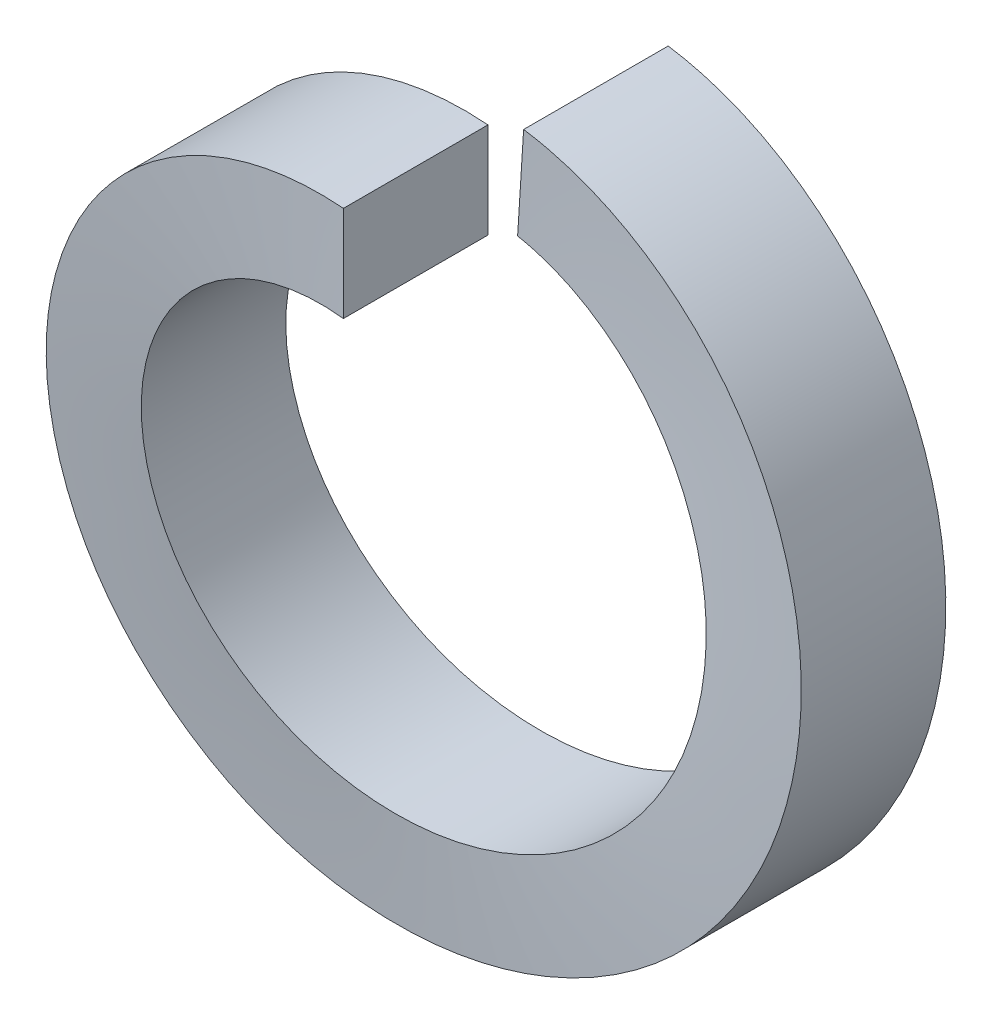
ISO-10303-21;
HEADER;
FILE_DESCRIPTION(('STEP AP214'),'2;1');
FILE_NAME('part.step','',(''),(''),'','','');
FILE_SCHEMA(('AUTOMOTIVE_DESIGN { 1 0 10303 214 1 1 1 1 }'));
ENDSEC;
DATA;
#1=APPLICATION_CONTEXT('core data for automotive mechanical design processes');
#2=APPLICATION_PROTOCOL_DEFINITION('international standard','automotive_design',2000,#1);
#3=PRODUCT_CONTEXT('',#1,'mechanical');
#4=PRODUCT('Part','Part','',(#3));
#5=PRODUCT_RELATED_PRODUCT_CATEGORY('part','',(#4));
#6=PRODUCT_DEFINITION_FORMATION('','',#4);
#7=PRODUCT_DEFINITION_CONTEXT('part definition',#1,'design');
#8=PRODUCT_DEFINITION('design','',#6,#7);
#9=PRODUCT_DEFINITION_SHAPE('','',#8);
#10=(LENGTH_UNIT() NAMED_UNIT(*) SI_UNIT(.MILLI.,.METRE.));
#11=(NAMED_UNIT(*) PLANE_ANGLE_UNIT() SI_UNIT($,.RADIAN.));
#12=(NAMED_UNIT(*) SI_UNIT($,.STERADIAN.) SOLID_ANGLE_UNIT());
#13=UNCERTAINTY_MEASURE_WITH_UNIT(LENGTH_MEASURE(1.E-05),#10,'distance_accuracy_value','');
#14=(GEOMETRIC_REPRESENTATION_CONTEXT(3) GLOBAL_UNCERTAINTY_ASSIGNED_CONTEXT((#13)) GLOBAL_UNIT_ASSIGNED_CONTEXT((#10,
#11,#12)) REPRESENTATION_CONTEXT('',''));
#15=CARTESIAN_POINT('',(0.,0.,0.));
#16=DIRECTION('',(0.,0.,1.));
#17=DIRECTION('',(1.,0.,0.));
#18=AXIS2_PLACEMENT_3D('',#15,#16,#17);
#19=CARTESIAN_POINT('',(0.,3.95605,1.9812));
#20=DIRECTION('',(1.,0.,0.));
#21=DIRECTION('',(0.,0.,-1.));
#22=AXIS2_PLACEMENT_3D('',#19,#20,#21);
#23=PLANE('',#22);
#24=CARTESIAN_POINT('',(0.,4.6101,1.9812));
#25=CARTESIAN_POINT('',(0.,3.302,1.9812));
#26=(BOUNDED_CURVE() B_SPLINE_CURVE(1,(#24,#25),.UNSPECIFIED.,.F.,
.F.) B_SPLINE_CURVE_WITH_KNOTS((2,2),(0.,1.),
.UNSPECIFIED.) CURVE() GEOMETRIC_REPRESENTATION_ITEM() RATIONAL_B_SPLINE_CURVE((1.,1.)) REPRESENTATION_ITEM(''));
#27=CARTESIAN_POINT('',(0.,4.6101,1.9812));
#28=VERTEX_POINT('',#27);
#29=CARTESIAN_POINT('',(0.,3.302,1.9812));
#30=VERTEX_POINT('',#29);
#31=EDGE_CURVE('E53',#28,#30,#26,.T.);
#32=ORIENTED_EDGE('',*,*,#31,.T.);
#33=CARTESIAN_POINT('',(0.,3.302,1.9812));
#34=CARTESIAN_POINT('',(0.,3.302,0.));
#35=(BOUNDED_CURVE() B_SPLINE_CURVE(1,(#33,#34),.UNSPECIFIED.,.F.,
.F.) B_SPLINE_CURVE_WITH_KNOTS((2,2),(0.,1.),
.UNSPECIFIED.) CURVE() GEOMETRIC_REPRESENTATION_ITEM() RATIONAL_B_SPLINE_CURVE((1.,1.)) REPRESENTATION_ITEM(''));
#36=CARTESIAN_POINT('',(0.,3.302,0.));
#37=VERTEX_POINT('',#36);
#38=EDGE_CURVE('E85',#30,#37,#35,.T.);
#39=ORIENTED_EDGE('',*,*,#38,.T.);
#40=CARTESIAN_POINT('',(0.,3.302,0.));
#41=CARTESIAN_POINT('',(0.,4.6101,0.));
#42=(BOUNDED_CURVE() B_SPLINE_CURVE(1,(#40,#41),.UNSPECIFIED.,.F.,
.F.) B_SPLINE_CURVE_WITH_KNOTS((2,2),(0.,1.),
.UNSPECIFIED.) CURVE() GEOMETRIC_REPRESENTATION_ITEM() RATIONAL_B_SPLINE_CURVE((1.,1.)) REPRESENTATION_ITEM(''));
#43=CARTESIAN_POINT('',(0.,4.6101,0.));
#44=VERTEX_POINT('',#43);
#45=EDGE_CURVE('E88',#37,#44,#42,.T.);
#46=ORIENTED_EDGE('',*,*,#45,.T.);
#47=CARTESIAN_POINT('',(0.,4.6101,0.));
#48=CARTESIAN_POINT('',(0.,4.6101,1.9812));
#49=(BOUNDED_CURVE() B_SPLINE_CURVE(1,(#47,#48),.UNSPECIFIED.,.F.,
.F.) B_SPLINE_CURVE_WITH_KNOTS((2,2),(0.,1.),
.UNSPECIFIED.) CURVE() GEOMETRIC_REPRESENTATION_ITEM() RATIONAL_B_SPLINE_CURVE((1.,1.)) REPRESENTATION_ITEM(''));
#50=EDGE_CURVE('E68',#44,#28,#49,.T.);
#51=ORIENTED_EDGE('',*,*,#50,.T.);
#52=EDGE_LOOP('',(#32,#39,#46,#51));
#53=FACE_BOUND('',#52,.T.);
#54=ADVANCED_FACE('F42',(#53),#23,.T.);
#55=CARTESIAN_POINT('',(0.227899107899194,3.62186201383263,-0.198642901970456));
#56=DIRECTION('',(0.998026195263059,-0.0627989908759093,1.77118714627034E-05));
#57=DIRECTION('',(0.0627989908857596,0.998026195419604,0.));
#58=AXIS2_PLACEMENT_3D('',#55,#56,#57);
#59=PLANE('',#58);
#60=CARTESIAN_POINT('',(0.28950962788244,4.60100056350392,-0.198642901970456));
#61=CARTESIAN_POINT('',(0.207362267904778,3.29548249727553,-0.198642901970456));
#62=(BOUNDED_CURVE() B_SPLINE_CURVE(1,(#60,#61),.UNSPECIFIED.,.F.,
.F.) B_SPLINE_CURVE_WITH_KNOTS((2,2),(0.,1.),
.UNSPECIFIED.) CURVE() GEOMETRIC_REPRESENTATION_ITEM() RATIONAL_B_SPLINE_CURVE((0.991095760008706,0.991095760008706)) REPRESENTATION_ITEM(''));
#63=CARTESIAN_POINT('',(0.207375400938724,3.29548167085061,-0.198641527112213));
#64=VERTEX_POINT('',#63);
#65=CARTESIAN_POINT('',(0.289509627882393,4.60100056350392,-0.198642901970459));
#66=VERTEX_POINT('',#65);
#67=EDGE_CURVE('E12',#64,#66,#62,.F.);
#68=ORIENTED_EDGE('',*,*,#67,.T.);
#69=CARTESIAN_POINT('',(0.289509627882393,4.60100056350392,-2.17984290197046));
#70=CARTESIAN_POINT('',(0.289509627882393,4.60100056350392,-0.198642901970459));
#71=(BOUNDED_CURVE() B_SPLINE_CURVE(1,(#69,#70),.UNSPECIFIED.,.F.,
.F.) B_SPLINE_CURVE_WITH_KNOTS((2,2),(0.,1.),
.UNSPECIFIED.) CURVE() GEOMETRIC_REPRESENTATION_ITEM() RATIONAL_B_SPLINE_CURVE((0.991095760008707,0.991095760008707)) REPRESENTATION_ITEM(''));
#72=CARTESIAN_POINT('',(0.289527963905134,4.60099940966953,-2.1798415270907));
#73=VERTEX_POINT('',#72);
#74=EDGE_CURVE('E134',#66,#73,#71,.F.);
#75=ORIENTED_EDGE('',*,*,#74,.T.);
#76=CARTESIAN_POINT('',(0.207388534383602,3.29548084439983,-2.17984015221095));
#77=CARTESIAN_POINT('',(0.289546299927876,4.60099825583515,-2.17984015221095));
#78=(BOUNDED_CURVE() B_SPLINE_CURVE(1,(#76,#77),.UNSPECIFIED.,.F.,
.F.) B_SPLINE_CURVE_WITH_KNOTS((2,2),(0.,1.),
.UNSPECIFIED.) CURVE() GEOMETRIC_REPRESENTATION_ITEM() RATIONAL_B_SPLINE_CURVE((0.9910947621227,0.9910947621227)) REPRESENTATION_ITEM(''));
#79=CARTESIAN_POINT('',(0.207388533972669,3.29548084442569,-2.17984015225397));
#80=VERTEX_POINT('',#79);
#81=EDGE_CURVE('E110',#73,#80,#78,.F.);
#82=ORIENTED_EDGE('',*,*,#81,.T.);
#83=CARTESIAN_POINT('',(0.207388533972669,3.29548084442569,-0.19864015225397));
#84=CARTESIAN_POINT('',(0.207388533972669,3.29548084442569,-2.17984015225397));
#85=(BOUNDED_CURVE() B_SPLINE_CURVE(1,(#83,#84),.UNSPECIFIED.,.F.,
.F.) B_SPLINE_CURVE_WITH_KNOTS((2,2),(0.,1.),
.UNSPECIFIED.) CURVE() GEOMETRIC_REPRESENTATION_ITEM() RATIONAL_B_SPLINE_CURVE((0.991094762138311,0.991094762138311)) REPRESENTATION_ITEM(''));
#86=EDGE_CURVE('E93',#80,#64,#85,.F.);
#87=ORIENTED_EDGE('',*,*,#86,.T.);
#88=EDGE_LOOP('',(#68,#75,#82,#87));
#89=FACE_BOUND('',#88,.T.);
#90=ADVANCED_FACE('F44',(#89),#59,.F.);
#91=CARTESIAN_POINT('',(0.,4.6101,1.9812));
#92=CARTESIAN_POINT('',(-1.49791229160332,4.6101,1.87113333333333));
#93=CARTESIAN_POINT('',(-2.70974879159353,3.72964924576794,1.76106666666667));
#94=CARTESIAN_POINT('',(-3.92158529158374,2.84919849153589,1.651));
#95=CARTESIAN_POINT('',(-4.38446564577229,1.42459924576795,1.54093333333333));
#96=CARTESIAN_POINT('',(-4.84734599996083,0.,1.43086666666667));
#97=CARTESIAN_POINT('',(-4.38446564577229,-1.42459924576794,1.3208));
#98=CARTESIAN_POINT('',(-3.92158529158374,-2.84919849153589,1.21073333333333));
#99=CARTESIAN_POINT('',(-2.70974879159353,-3.72964924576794,1.10066666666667));
#100=CARTESIAN_POINT('',(-1.49791229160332,-4.6101,0.9906));
#101=CARTESIAN_POINT('',(0.,-4.6101,0.880533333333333));
#102=CARTESIAN_POINT('',(1.49791229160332,-4.6101,0.770466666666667));
#103=CARTESIAN_POINT('',(2.70974879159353,-3.72964924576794,0.6604));
#104=CARTESIAN_POINT('',(3.92158529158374,-2.84919849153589,0.550333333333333));
#105=CARTESIAN_POINT('',(4.38446564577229,-1.42459924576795,0.440266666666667));
#106=CARTESIAN_POINT('',(4.84734599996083,0.,0.3302));
#107=CARTESIAN_POINT('',(4.38446564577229,1.42459924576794,0.220133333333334));
#108=CARTESIAN_POINT('',(3.92158529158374,2.84919849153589,0.110066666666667));
#109=CARTESIAN_POINT('',(2.70974879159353,3.72964924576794,0.));
#110=CARTESIAN_POINT('',(1.6262026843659,4.51689157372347,-0.098414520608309));
#111=CARTESIAN_POINT('',(0.28950962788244,4.60100056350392,-0.198642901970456));
#112=CARTESIAN_POINT('',(0.,3.302,1.9812));
#113=CARTESIAN_POINT('',(-1.07288483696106,3.302,1.87113333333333));
#114=CARTESIAN_POINT('',(-1.94086690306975,2.67137411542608,1.76106666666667));
#115=CARTESIAN_POINT('',(-2.80884896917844,2.04074823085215,1.651));
#116=CARTESIAN_POINT('',(-3.1403886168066,1.02037411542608,1.54093333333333));
#117=CARTESIAN_POINT('',(-3.47192826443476,0.,1.43086666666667));
#118=CARTESIAN_POINT('',(-3.1403886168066,-1.02037411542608,1.3208));
#119=CARTESIAN_POINT('',(-2.80884896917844,-2.04074823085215,1.21073333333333));
#120=CARTESIAN_POINT('',(-1.94086690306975,-2.67137411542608,1.10066666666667));
#121=CARTESIAN_POINT('',(-1.07288483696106,-3.302,0.9906));
#122=CARTESIAN_POINT('',(0.,-3.302,0.880533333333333));
#123=CARTESIAN_POINT('',(1.07288483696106,-3.302,0.770466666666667));
#124=CARTESIAN_POINT('',(1.94086690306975,-2.67137411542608,0.6604));
#125=CARTESIAN_POINT('',(2.80884896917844,-2.04074823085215,0.550333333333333));
#126=CARTESIAN_POINT('',(3.1403886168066,-1.02037411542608,0.440266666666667));
#127=CARTESIAN_POINT('',(3.47192826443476,0.,0.3302));
#128=CARTESIAN_POINT('',(3.1403886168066,1.02037411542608,0.220133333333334));
#129=CARTESIAN_POINT('',(2.80884896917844,2.04074823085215,0.110066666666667));
#130=CARTESIAN_POINT('',(1.94086690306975,2.67137411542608,0.));
#131=CARTESIAN_POINT('',(1.16477327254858,3.23523914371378,-0.098414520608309));
#132=CARTESIAN_POINT('',(0.207362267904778,3.29548249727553,-0.198642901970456));
#133=(BOUNDED_SURFACE() B_SPLINE_SURFACE(1,2,((#91,#92,#93,#94,#95,#96,#97,#98,#99,#100,#101,
#102,#103,#104,#105,#106,#107,#108,#109,#110,#111),(#112,#113,#114,#115,#116,#117,#118,#119,
#120,#121,#122,#123,#124,#125,#126,#127,#128,#129,#130,#131,#132)),.UNSPECIFIED.,.F.,.F.,
.F.) B_SPLINE_SURFACE_WITH_KNOTS((2,2),(3,2,2,2,2,2,2,2,2,2,3),(0.,1.),(0.,0.1,0.2,0.3,0.4,0.5,
0.6,0.7,0.8,0.9,0.989879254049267),
.UNSPECIFIED.) GEOMETRIC_REPRESENTATION_ITEM() RATIONAL_B_SPLINE_SURFACE(((1.,0.951056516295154,
1.,0.951056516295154,1.,0.951056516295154,1.,0.951056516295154,1.,0.951056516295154,1.,
0.951056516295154,1.,0.951056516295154,1.,0.951056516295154,1.,0.951056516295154,1.,
0.95600996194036,0.991095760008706),(1.,0.951056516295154,1.,0.951056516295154,1.,
0.951056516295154,1.,0.951056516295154,1.,0.951056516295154,1.,0.951056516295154,1.,
0.951056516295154,1.,0.951056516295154,1.,0.951056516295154,1.,0.95600996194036,0.991095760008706))) REPRESENTATION_ITEM('') SURFACE());
#134=CARTESIAN_POINT('',(0.,4.6101,1.9812));
#135=CARTESIAN_POINT('',(-1.49791229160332,4.6101,1.87113333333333));
#136=CARTESIAN_POINT('',(-2.70974879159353,3.72964924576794,1.76106666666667));
#137=CARTESIAN_POINT('',(-3.92158529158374,2.84919849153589,1.651));
#138=CARTESIAN_POINT('',(-4.38446564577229,1.42459924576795,1.54093333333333));
#139=CARTESIAN_POINT('',(-4.84734599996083,0.,1.43086666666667));
#140=CARTESIAN_POINT('',(-4.38446564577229,-1.42459924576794,1.3208));
#141=CARTESIAN_POINT('',(-3.92158529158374,-2.84919849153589,1.21073333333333));
#142=CARTESIAN_POINT('',(-2.70974879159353,-3.72964924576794,1.10066666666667));
#143=CARTESIAN_POINT('',(-1.49791229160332,-4.6101,0.9906));
#144=CARTESIAN_POINT('',(0.,-4.6101,0.880533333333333));
#145=CARTESIAN_POINT('',(1.49791229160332,-4.6101,0.770466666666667));
#146=CARTESIAN_POINT('',(2.70974879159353,-3.72964924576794,0.6604));
#147=CARTESIAN_POINT('',(3.92158529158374,-2.84919849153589,0.550333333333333));
#148=CARTESIAN_POINT('',(4.38446564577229,-1.42459924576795,0.440266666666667));
#149=CARTESIAN_POINT('',(4.84734599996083,0.,0.3302));
#150=CARTESIAN_POINT('',(4.38446564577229,1.42459924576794,0.220133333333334));
#151=CARTESIAN_POINT('',(3.92158529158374,2.84919849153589,0.110066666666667));
#152=CARTESIAN_POINT('',(2.70974879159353,3.72964924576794,0.));
#153=CARTESIAN_POINT('',(1.62620268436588,4.51689157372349,-0.0984145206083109));
#154=CARTESIAN_POINT('',(0.289509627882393,4.60100056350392,-0.198642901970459));
#155=(BOUNDED_CURVE() B_SPLINE_CURVE(2,(#134,#135,#136,#137,#138,#139,#140,#141,#142,#143,#144,
#145,#146,#147,#148,#149,#150,#151,#152,#153,#154),.UNSPECIFIED.,.F.,
.F.) B_SPLINE_CURVE_WITH_KNOTS((3,2,2,2,2,2,2,2,2,2,3),(0.,0.1,0.2,0.3,0.4,0.5,0.6,0.7,0.8,0.9,
0.989879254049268),
.UNSPECIFIED.) CURVE() GEOMETRIC_REPRESENTATION_ITEM() RATIONAL_B_SPLINE_CURVE((1.,
0.951056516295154,1.,0.951056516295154,1.,0.951056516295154,1.,0.951056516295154,1.,
0.951056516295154,1.,0.951056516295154,1.,0.951056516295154,1.,0.951056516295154,1.,
0.951056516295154,1.,0.956009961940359,0.991095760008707)) REPRESENTATION_ITEM(''));
#156=EDGE_CURVE('E60',#28,#66,#155,.T.);
#157=CARTESIAN_POINT('',(0.,3.302,1.9812));
#158=CARTESIAN_POINT('',(-0.0383632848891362,3.30200028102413,1.97726434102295));
#159=CARTESIAN_POINT('',(-0.0767242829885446,3.30133144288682,1.97330661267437));
#160=CARTESIAN_POINT('',(-0.153588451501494,3.29865129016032,1.96533182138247));
#161=CARTESIAN_POINT('',(-0.192091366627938,3.29663324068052,1.96131456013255));
#162=CARTESIAN_POINT('',(-0.269168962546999,3.29123856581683,1.9532273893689));
#163=CARTESIAN_POINT('',(-0.307743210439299,3.28785598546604,1.94915732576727));
#164=CARTESIAN_POINT('',(-0.384891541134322,3.27972143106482,1.94097156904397));
#165=CARTESIAN_POINT('',(-0.423465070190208,3.27496432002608,1.93685576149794));
#166=CARTESIAN_POINT('',(-0.5005388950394,3.26407480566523,1.92858581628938));
#167=CARTESIAN_POINT('',(-0.539038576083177,3.25793811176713,1.92443159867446));
#168=CARTESIAN_POINT('',(-0.615890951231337,3.24428872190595,1.91609237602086));
#169=CARTESIAN_POINT('',(-0.654243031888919,3.23677260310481,1.91190731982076));
#170=CARTESIAN_POINT('',(-0.730726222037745,3.22036888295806,1.90351416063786));
#171=CARTESIAN_POINT('',(-0.768856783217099,3.21147873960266,1.8993060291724));
#172=CARTESIAN_POINT('',(-0.844823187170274,3.19233676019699,1.89087461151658));
#173=CARTESIAN_POINT('',(-0.882658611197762,3.18208326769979,1.88665131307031));
#174=CARTESIAN_POINT('',(-0.957961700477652,3.16022962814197,1.87819755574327));
#175=CARTESIAN_POINT('',(-0.995429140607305,3.14862870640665,1.87396709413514));
#176=CARTESIAN_POINT('',(-1.06992439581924,3.12410042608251,1.8655070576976));
#177=CARTESIAN_POINT('',(-1.10695224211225,3.11117316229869,1.86127748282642));
#178=CARTESIAN_POINT('',(-1.18049807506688,3.08401747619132,1.85282726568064));
#179=CARTESIAN_POINT('',(-1.2170164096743,3.0697899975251,1.84860661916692));
#180=CARTESIAN_POINT('',(-1.28947505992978,3.04006405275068,1.84018226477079));
#181=CARTESIAN_POINT('',(-1.32541609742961,3.02456735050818,1.83597854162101));
#182=CARTESIAN_POINT('',(-1.39665448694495,2.99233781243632,1.82759590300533));
#183=CARTESIAN_POINT('',(-1.43195298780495,2.97560752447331,1.82341695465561));
#184=CARTESIAN_POINT('',(-1.5018435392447,2.94095008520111,1.8150917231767));
#185=CARTESIAN_POINT('',(-1.53643721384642,2.92302622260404,1.81094538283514));
#186=CARTESIAN_POINT('',(-1.60485856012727,2.88602506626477,1.80269251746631));
#187=CARTESIAN_POINT('',(-1.63868837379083,2.86695175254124,1.79858590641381));
#188=CARTESIAN_POINT('',(-1.70552618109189,2.82769881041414,1.79042130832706));
#189=CARTESIAN_POINT('',(-1.7385368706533,2.8075237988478,1.78636319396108));
#190=CARTESIAN_POINT('',(-1.80368390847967,2.76611845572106,1.7782970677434));
#191=CARTESIAN_POINT('',(-1.83582353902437,2.74489331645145,1.77428891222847));
#192=CARTESIAN_POINT('',(-1.89919076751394,2.70143426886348,1.76634891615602));
#193=CARTESIAN_POINT('',(-1.93042204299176,2.6792057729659,1.76241679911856));
#194=CARTESIAN_POINT('',(-1.99215336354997,2.63362945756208,1.75451657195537));
#195=CARTESIAN_POINT('',(-2.02265175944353,2.61027941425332,1.75054840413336));
#196=CARTESIAN_POINT('',(-2.08295930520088,2.56241561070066,1.74255010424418));
#197=CARTESIAN_POINT('',(-2.11276435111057,2.53789671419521,1.73851976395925));
#198=CARTESIAN_POINT('',(-2.17161971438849,2.48772456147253,1.73040905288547));
#199=CARTESIAN_POINT('',(-2.20066626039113,2.46206690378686,1.72632854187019));
#200=CARTESIAN_POINT('',(-2.25794031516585,2.40965183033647,1.71812317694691));
#201=CARTESIAN_POINT('',(-2.28616444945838,2.38289074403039,1.71399821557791));
#202=CARTESIAN_POINT('',(-2.34173165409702,2.32830800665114,1.70571168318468));
#203=CARTESIAN_POINT('',(-2.36907181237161,2.30048340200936,1.70155003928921));
#204=CARTESIAN_POINT('',(-2.42281156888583,2.24381738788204,1.69319763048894));
#205=CARTESIAN_POINT('',(-2.44920877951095,2.21497372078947,1.6890068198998));
#206=CARTESIAN_POINT('',(-2.50100613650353,2.15631765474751,1.68060388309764));
#207=CARTESIAN_POINT('',(-2.526404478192,2.12650366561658,1.67639173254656));
#208=CARTESIAN_POINT('',(-2.57615096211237,2.06595909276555,1.66795402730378));
#209=CARTESIAN_POINT('',(-2.60049793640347,2.03522755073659,1.66372846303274));
#210=CARTESIAN_POINT('',(-2.64809228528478,1.97290377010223,1.65527194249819));
#211=CARTESIAN_POINT('',(-2.67133917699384,1.94131116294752,1.65104098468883));
#212=CARTESIAN_POINT('',(-2.71668802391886,1.87732457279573,1.64258172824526));
#213=CARTESIAN_POINT('',(-2.73879022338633,1.84493076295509,1.63835342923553));
#214=CARTESIAN_POINT('',(-2.78180870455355,1.77940413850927,1.62990753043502));
#215=CARTESIAN_POINT('',(-2.80272599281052,1.74627198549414,1.62568992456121));
#216=CARTESIAN_POINT('',(-2.84333827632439,1.67933369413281,1.61727339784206));
#217=CARTESIAN_POINT('',(-2.86303506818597,1.64552864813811,1.61307445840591));
#218=CARTESIAN_POINT('',(-2.9011747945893,1.57731181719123,1.60470311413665));
#219=CARTESIAN_POINT('',(-2.9196203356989,1.54290149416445,1.60053067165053));
#220=CARTESIAN_POINT('',(-2.95523096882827,1.47354312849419,1.59222010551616));
#221=CARTESIAN_POINT('',(-2.97239948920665,1.43859685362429,1.58808191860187));
#222=CARTESIAN_POINT('',(-3.00543456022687,1.36823696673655,1.57984709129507));
#223=CARTESIAN_POINT('',(-3.02130536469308,1.33282536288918,1.57575035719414));
#224=CARTESIAN_POINT('',(-3.05172865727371,1.26160594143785,1.56760671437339));
#225=CARTESIAN_POINT('',(-3.06628622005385,1.22580030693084,1.56355967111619));
#226=CARTESIAN_POINT('',(-3.09407171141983,1.15386483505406,1.55551857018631));
#227=CARTESIAN_POINT('',(-3.10730552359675,1.11773728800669,1.5515243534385));
#228=CARTESIAN_POINT('',(-3.13245141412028,1.04518882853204,1.54360533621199));
#229=CARTESIAN_POINT('',(-3.14436879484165,1.00876977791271,1.53968031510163));
#230=CARTESIAN_POINT('',(-3.16696818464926,0.935411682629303,1.5317698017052));
#231=CARTESIAN_POINT('',(-3.17764558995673,0.898471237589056,1.52778414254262));
#232=CARTESIAN_POINT('',(-3.19775070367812,0.82406704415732,1.51975755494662));
#233=CARTESIAN_POINT('',(-3.2071722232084,0.786601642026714,1.51571645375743));
#234=CARTESIAN_POINT('',(-3.2247305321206,0.711211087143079,1.50758434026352));
#235=CARTESIAN_POINT('',(-3.23286184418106,0.673284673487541,1.50349319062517));
#236=CARTESIAN_POINT('',(-3.24780907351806,0.597038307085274,1.49526852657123));
#237=CARTESIAN_POINT('',(-3.25462027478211,0.558717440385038,1.49113491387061));
#238=CARTESIAN_POINT('',(-3.26690114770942,0.481750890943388,1.48283262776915));
#239=CARTESIAN_POINT('',(-3.27236690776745,0.443104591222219,1.47866388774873));
#240=CARTESIAN_POINT('',(-3.28193556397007,0.365557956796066,1.47029901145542));
#241=CARTESIAN_POINT('',(-3.28603538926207,0.326657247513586,1.46610283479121));
#242=CARTESIAN_POINT('',(-3.29285583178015,0.248674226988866,1.45769089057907));
#243=CARTESIAN_POINT('',(-3.29557424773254,0.209591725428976,1.45347510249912));
#244=CARTESIAN_POINT('',(-3.29962067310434,0.131318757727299,1.44503188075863));
#245=CARTESIAN_POINT('',(-3.30094737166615,0.0921282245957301,1.44080443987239));
#246=CARTESIAN_POINT('',(-3.30220441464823,0.0137135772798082,1.43234593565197));
#247=CARTESIAN_POINT('',(-3.30213435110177,-0.0255105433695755,1.42811487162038));
#248=CARTESIAN_POINT('',(-3.30059722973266,-0.10391770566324,1.41965717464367));
#249=CARTESIAN_POINT('',(-3.2991306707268,-0.143100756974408,1.4154305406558));
#250=CARTESIAN_POINT('',(-3.29480523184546,-0.221351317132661,1.40698973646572));
#251=CARTESIAN_POINT('',(-3.29194775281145,-0.26041890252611,1.40277555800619));
#252=CARTESIAN_POINT('',(-3.28485041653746,-0.338364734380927,1.39436762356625));
#253=CARTESIAN_POINT('',(-3.28061284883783,-0.377243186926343,1.39017384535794));
#254=CARTESIAN_POINT('',(-3.27077045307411,-0.454738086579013,1.38181455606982));
#255=CARTESIAN_POINT('',(-3.26516878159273,-0.493354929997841,1.3776490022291));
#256=CARTESIAN_POINT('',(-3.25261832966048,-0.570255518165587,1.36935380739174));
#257=CARTESIAN_POINT('',(-3.24567354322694,-0.608539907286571,1.3652240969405));
#258=CARTESIAN_POINT('',(-3.23046185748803,-0.68470650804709,1.35700812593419));
#259=CARTESIAN_POINT('',(-3.22219975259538,-0.722589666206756,1.3529217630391));
#260=CARTESIAN_POINT('',(-3.20438304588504,-0.797887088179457,1.34479936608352));
#261=CARTESIAN_POINT('',(-3.1948339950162,-0.835302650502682,1.34076319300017));
#262=CARTESIAN_POINT('',(-3.17447734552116,-0.909601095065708,1.33274923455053));
#263=CARTESIAN_POINT('',(-3.16367600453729,-0.946485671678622,1.32877126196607));
#264=CARTESIAN_POINT('',(-3.14082491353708,-1.01975037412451,1.32086629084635));
#265=CARTESIAN_POINT('',(-3.12877895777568,-1.05613167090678,1.31693917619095));
#266=CARTESIAN_POINT('',(-3.10337194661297,-1.12861342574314,1.30901146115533));
#267=CARTESIAN_POINT('',(-3.09000511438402,-1.16471183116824,1.30501060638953));
#268=CARTESIAN_POINT('',(-3.06195428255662,-1.23658190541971,1.29695783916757));
#269=CARTESIAN_POINT('',(-3.0472644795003,-1.27235129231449,1.29290577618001));
#270=CARTESIAN_POINT('',(-3.01657796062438,-1.34349099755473,1.28475254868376));
#271=CARTESIAN_POINT('',(-3.00057625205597,-1.37885914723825,1.2806512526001));
#272=CARTESIAN_POINT('',(-2.96728113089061,-1.44912498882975,1.27240810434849));
#273=CARTESIAN_POINT('',(-2.94998354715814,-1.48402069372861,1.26826616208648));
#274=CARTESIAN_POINT('',(-2.91411706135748,-1.55327087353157,1.25994882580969));
#275=CARTESIAN_POINT('',(-2.89554481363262,-1.58762360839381,1.25577337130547));
#276=CARTESIAN_POINT('',(-2.85715445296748,-1.65571836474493,1.2473967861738));
#277=CARTESIAN_POINT('',(-2.8373338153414,-1.68945895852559,1.24319562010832));
#278=CARTESIAN_POINT('',(-2.79647711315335,-1.75626163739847,1.23477543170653));
#279=CARTESIAN_POINT('',(-2.77543933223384,-1.7893226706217,1.2305563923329));
#280=CARTESIAN_POINT('',(-2.73218361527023,-1.85470058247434,1.2221084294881));
#281=CARTESIAN_POINT('',(-2.70996475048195,-1.8870168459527,1.21787950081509));
#282=CARTESIAN_POINT('',(-2.66438677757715,-1.95084214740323,1.20941979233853));
#283=CARTESIAN_POINT('',(-2.64102749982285,-1.98235106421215,1.20518901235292));
#284=CARTESIAN_POINT('',(-2.59321301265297,-2.04450158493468,1.19673365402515));
#285=CARTESIAN_POINT('',(-2.56875835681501,-2.07514361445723,1.19250907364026));
#286=CARTESIAN_POINT('',(-2.51880154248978,-2.13550363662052,1.18407413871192));
#287=CARTESIAN_POINT('',(-2.49330061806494,-2.16522264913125,1.17986377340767));
#288=CARTESIAN_POINT('',(-2.44130349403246,-2.22368362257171,1.17146519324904));
#289=CARTESIAN_POINT('',(-2.41480916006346,-2.25242723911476,1.16727695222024));
#290=CARTESIAN_POINT('',(-2.36088088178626,-2.30888842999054,1.15893047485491));
#291=CARTESIAN_POINT('',(-2.33344938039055,-2.33660833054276,1.15477219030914));
#292=CARTESIAN_POINT('',(-2.27770550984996,-2.39097737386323,1.14649306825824));
#293=CARTESIAN_POINT('',(-2.24939610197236,-2.41762954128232,1.14237215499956));
#294=CARTESIAN_POINT('',(-2.19195774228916,-2.46982297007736,1.13417585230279));
#295=CARTESIAN_POINT('',(-2.16283220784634,-2.49536797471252,1.13010035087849));
#296=CARTESIAN_POINT('',(-2.10382540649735,-2.54531142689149,1.12199948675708));
#297=CARTESIAN_POINT('',(-2.07394794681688,-2.56971434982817,1.11797398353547));
#298=CARTESIAN_POINT('',(-2.01350192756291,-2.61734354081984,1.10998926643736));
#299=CARTESIAN_POINT('',(-1.98293750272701,-2.6405750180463,1.10602982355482));
#300=CARTESIAN_POINT('',(-1.92105272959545,-2.68593193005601,1.09813200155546));
#301=CARTESIAN_POINT('',(-1.88973332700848,-2.70805865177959,1.09419360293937));
#302=CARTESIAN_POINT('',(-1.8261885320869,-2.75131317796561,1.08624174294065));
#303=CARTESIAN_POINT('',(-1.79395937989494,-2.77243540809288,1.08222800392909));
#304=CARTESIAN_POINT('',(-1.72863823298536,-2.81362958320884,1.07415118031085));
#305=CARTESIAN_POINT('',(-1.69554301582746,-2.83369639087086,1.07008795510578));
#306=CARTESIAN_POINT('',(-1.628541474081,-2.87272791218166,1.06191390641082));
#307=CARTESIAN_POINT('',(-1.59463251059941,-2.89168807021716,1.05780295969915));
#308=CARTESIAN_POINT('',(-1.52605856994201,-2.92845825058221,1.04954214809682));
#309=CARTESIAN_POINT('',(-1.49139150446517,-2.94626435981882,1.04539220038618));
#310=CARTESIAN_POINT('',(-1.42136022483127,-2.98068201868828,1.03706052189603));
#311=CARTESIAN_POINT('',(-1.38599443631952,-2.99729035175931,1.03287873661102));
#312=CARTESIAN_POINT('',(-1.31462784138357,-3.02927212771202,1.02449120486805));
#313=CARTESIAN_POINT('',(-1.27862593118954,-3.04464309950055,1.0202854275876));
#314=CARTESIAN_POINT('',(-1.20605218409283,-3.07411418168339,1.01185776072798));
#315=CARTESIAN_POINT('',(-1.16947966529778,-3.08821260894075,1.00763585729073));
#316=CARTESIAN_POINT('',(-1.09583235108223,-3.11510726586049,0.999183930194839));
#317=CARTESIAN_POINT('',(-1.05875724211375,-3.127902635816,0.99495390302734));
#318=CARTESIAN_POINT('',(-0.984174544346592,-3.15216469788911,0.986493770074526));
#319=CARTESIAN_POINT('',(-0.946666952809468,-3.16363138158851,0.982263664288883));
#320=CARTESIAN_POINT('',(-0.871290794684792,-3.1852146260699,0.973811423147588));
#321=CARTESIAN_POINT('',(-0.833422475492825,-3.19533204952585,0.969589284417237));
#322=CARTESIAN_POINT('',(-0.757397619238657,-3.21420049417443,0.961160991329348));
#323=CARTESIAN_POINT('',(-0.719241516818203,-3.22295326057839,0.956954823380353));
#324=CARTESIAN_POINT('',(-0.642714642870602,-3.23908135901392,0.948566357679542));
#325=CARTESIAN_POINT('',(-0.604344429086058,-3.24645932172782,0.944384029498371));
#326=CARTESIAN_POINT('',(-0.527463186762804,-3.25983205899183,0.936051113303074));
#327=CARTESIAN_POINT('',(-0.488952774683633,-3.2658303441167,0.931900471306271));
#328=CARTESIAN_POINT('',(-0.411864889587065,-3.27644323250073,0.923638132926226));
#329=CARTESIAN_POINT('',(-0.373288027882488,-3.28106221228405,0.919526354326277));
#330=CARTESIAN_POINT('',(-0.296140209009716,-3.288921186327,0.911350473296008));
#331=CARTESIAN_POINT('',(-0.257569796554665,-3.29216640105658,0.907286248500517));
#332=CARTESIAN_POINT('',(-0.180507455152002,-3.2972876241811,0.899207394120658));
#333=CARTESIAN_POINT('',(-0.142015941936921,-3.29916966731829,0.895192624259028));
#334=CARTESIAN_POINT('',(-0.0651778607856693,-3.30157928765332,0.88723828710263));
#335=CARTESIAN_POINT('',(-0.0268315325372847,-3.3021136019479,0.883298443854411));
#336=CARTESIAN_POINT('',(0.0498938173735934,-3.30184612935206,0.875400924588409));
#337=CARTESIAN_POINT('',(0.0882728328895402,-3.3010429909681,0.871443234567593));
#338=CARTESIAN_POINT('',(0.16516522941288,-3.29809219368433,0.863461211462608));
#339=CARTESIAN_POINT('',(0.2036783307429,-3.29593787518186,0.85943664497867));
#340=CARTESIAN_POINT('',(0.280769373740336,-3.29026941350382,0.851337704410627));
#341=CARTESIAN_POINT('',(0.319346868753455,-3.28674939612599,0.847263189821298));
#342=CARTESIAN_POINT('',(0.396494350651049,-3.27833913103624,0.839068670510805));
#343=CARTESIAN_POINT('',(0.4350637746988,-3.2734438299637,0.834948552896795));
#344=CARTESIAN_POINT('',(0.512122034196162,-3.2622776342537,0.826670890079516));
#345=CARTESIAN_POINT('',(0.55061025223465,-3.25600253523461,0.822513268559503));
#346=CARTESIAN_POINT('',(0.627432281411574,-3.24207655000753,0.814167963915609));
#347=CARTESIAN_POINT('',(0.665765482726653,-3.23442232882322,0.809980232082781));
#348=CARTESIAN_POINT('',(0.742203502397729,-3.2177431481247,0.801582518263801));
#349=CARTESIAN_POINT('',(0.780307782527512,-3.20871573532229,0.797372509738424));
#350=CARTESIAN_POINT('',(0.856214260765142,-3.18930048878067,0.788938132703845));
#351=CARTESIAN_POINT('',(0.894016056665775,-3.17891108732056,0.784713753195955));
#352=CARTESIAN_POINT('',(0.969244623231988,-3.15678742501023,0.776258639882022));
#353=CARTESIAN_POINT('',(1.00667119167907,-3.14505247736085,0.772027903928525));
#354=CARTESIAN_POINT('',(1.08107758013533,-3.12025845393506,0.763568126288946));
#355=CARTESIAN_POINT('',(1.11805746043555,-3.10719955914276,0.759339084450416));
#356=CARTESIAN_POINT('',(1.19150042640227,-3.07978341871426,0.750890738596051));
#357=CARTESIAN_POINT('',(1.22796389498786,-3.0654272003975,0.746671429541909));
#358=CARTESIAN_POINT('',(1.30030610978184,-3.03544706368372,0.738250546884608));
#359=CARTESIAN_POINT('',(1.33618561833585,-3.01982498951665,0.734048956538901));
#360=CARTESIAN_POINT('',(1.40729451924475,-2.98734845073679,0.725671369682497));
#361=CARTESIAN_POINT('',(1.44252510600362,-2.97049661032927,0.721495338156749));
#362=CARTESIAN_POINT('',(1.51227370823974,-2.93560023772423,0.713176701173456));
#363=CARTESIAN_POINT('',(1.5467933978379,-2.91755906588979,0.709034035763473));
#364=CARTESIAN_POINT('',(1.61506100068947,-2.88032785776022,0.700789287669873));
#365=CARTESIAN_POINT('',(1.648811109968,-2.86114186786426,0.696687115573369));
#366=CARTESIAN_POINT('',(1.71548410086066,-2.82166850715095,0.688532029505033));
#367=CARTESIAN_POINT('',(1.74840973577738,-2.80138581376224,0.684478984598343));
#368=CARTESIAN_POINT('',(1.81338169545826,-2.75977034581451,0.676423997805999));
#369=CARTESIAN_POINT('',(1.84543136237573,-2.73844281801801,0.672421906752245));
#370=CARTESIAN_POINT('',(1.90862355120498,-2.69477793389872,0.664492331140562));
#371=CARTESIAN_POINT('',(1.93976958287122,-2.67244570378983,0.660564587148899));
#372=CARTESIAN_POINT('',(2.00134961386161,-2.62664813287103,0.652660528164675));
#373=CARTESIAN_POINT('',(2.03178134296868,-2.60317975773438,0.648684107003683));
#374=CARTESIAN_POINT('',(2.09194910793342,-2.5550818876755,0.640672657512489));
#375=CARTESIAN_POINT('',(2.12168107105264,-2.5304473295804,0.636637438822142));
#376=CARTESIAN_POINT('',(2.18038368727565,-2.48004714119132,0.628516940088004));
#377=CARTESIAN_POINT('',(2.20935060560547,-2.4542771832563,0.624431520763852));
#378=CARTESIAN_POINT('',(2.26645909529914,-2.4016412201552,0.616217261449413));
#379=CARTESIAN_POINT('',(2.29459733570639,-2.37477161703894,0.612088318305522));
#380=CARTESIAN_POINT('',(2.34998666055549,-2.31997603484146,0.603794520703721));
#381=CARTESIAN_POINT('',(2.37723488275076,-2.29204717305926,0.599629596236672));
#382=CARTESIAN_POINT('',(2.43078496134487,-2.23517727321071,0.591271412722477));
#383=CARTESIAN_POINT('',(2.45708448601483,-2.20623404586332,0.587078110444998));
#384=CARTESIAN_POINT('',(2.50868098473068,-2.14738390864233,0.578670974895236));
#385=CARTESIAN_POINT('',(2.53397621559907,-2.117475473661,0.574457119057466));
#386=CARTESIAN_POINT('',(2.58351135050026,-2.05674744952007,0.566016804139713));
#387=CARTESIAN_POINT('',(2.60775015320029,-2.02592696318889,0.561790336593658));
#388=CARTESIAN_POINT('',(2.65512342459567,-1.96343109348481,0.553332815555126));
#389=CARTESIAN_POINT('',(2.67825748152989,-1.93175539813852,0.549101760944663));
#390=CARTESIAN_POINT('',(2.72337634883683,-1.86760875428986,0.540643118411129));
#391=CARTESIAN_POINT('',(2.74536147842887,-1.83513803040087,0.536415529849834));
#392=CARTESIAN_POINT('',(2.78814196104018,-1.76946398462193,0.527971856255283));
#393=CARTESIAN_POINT('',(2.80893839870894,-1.73626137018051,0.523755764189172));
#394=CARTESIAN_POINT('',(2.84930559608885,-1.66918880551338,0.515343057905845));
#395=CARTESIAN_POINT('',(2.86887823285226,-1.63531998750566,0.511146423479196));
#396=CARTESIAN_POINT('',(2.90676675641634,-1.56698246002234,0.502780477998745));
#397=CARTESIAN_POINT('',(2.92508533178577,-1.53251524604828,0.498611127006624));
#398=CARTESIAN_POINT('',(2.96043964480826,-1.46305010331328,0.490307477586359));
#399=CARTESIAN_POINT('',(2.97747889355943,-1.42805396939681,0.486173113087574));
#400=CARTESIAN_POINT('',(3.01025355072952,-1.35760146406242,0.477946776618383));
#401=CARTESIAN_POINT('',(3.02599329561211,-1.32214712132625,0.473854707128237));
#402=CARTESIAN_POINT('',(3.05615309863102,-1.25084943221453,0.465720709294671));
#403=CARTESIAN_POINT('',(3.07057831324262,-1.21500828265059,0.461678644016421));
#404=CARTESIAN_POINT('',(3.09809831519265,-1.14300882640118,0.45364964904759));
#405=CARTESIAN_POINT('',(3.11119906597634,-1.10685281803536,0.44966254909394));
#406=CARTESIAN_POINT('',(3.13608503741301,-1.03423507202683,0.441750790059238));
#407=CARTESIAN_POINT('',(3.14787494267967,-0.997774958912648,0.437825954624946));
#408=CARTESIAN_POINT('',(3.17022321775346,-0.924320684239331,0.429908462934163));
#409=CARTESIAN_POINT('',(3.18077631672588,-0.88732494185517,0.425915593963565));
#410=CARTESIAN_POINT('',(3.20062917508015,-0.812816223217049,0.417876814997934));
#411=CARTESIAN_POINT('',(3.2099228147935,-0.775301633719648,0.413830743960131));
#412=CARTESIAN_POINT('',(3.22722207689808,-0.699819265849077,0.405688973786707));
#413=CARTESIAN_POINT('',(3.23522229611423,-0.661850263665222,0.401593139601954));
#414=CARTESIAN_POINT('',(3.24990451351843,-0.585525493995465,0.393359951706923));
#415=CARTESIAN_POINT('',(3.2565818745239,-0.547168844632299,0.389222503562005));
#416=CARTESIAN_POINT('',(3.26859270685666,-0.470137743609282,0.380913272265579));
#417=CARTESIAN_POINT('',(3.27392234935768,-0.431462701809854,0.376741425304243));
#418=CARTESIAN_POINT('',(3.28321690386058,-0.353865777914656,0.368371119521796));
#419=CARTESIAN_POINT('',(3.28717883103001,-0.314943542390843,0.364172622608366));
#420=CARTESIAN_POINT('',(3.29372212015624,-0.236924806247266,0.355756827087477));
#421=CARTESIAN_POINT('',(3.29630136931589,-0.197828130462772,0.35153950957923));
#422=CARTESIAN_POINT('',(3.3000686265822,-0.119534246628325,0.343094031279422));
#423=CARTESIAN_POINT('',(3.30125541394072,-0.0803369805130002,0.338865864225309));
#424=CARTESIAN_POINT('',(3.30223233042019,-0.00191634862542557,0.330406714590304));
#425=CARTESIAN_POINT('',(3.30202214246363,0.0373070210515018,0.326175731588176));
#426=CARTESIAN_POINT('',(3.30020500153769,0.115705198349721,0.317719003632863));
#427=CARTESIAN_POINT('',(3.29859863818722,0.154880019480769,0.313493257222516));
#428=CARTESIAN_POINT('',(3.29399435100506,0.233106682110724,0.305055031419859));
#429=CARTESIAN_POINT('',(3.29099791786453,0.272158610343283,0.300842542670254));
#430=CARTESIAN_POINT('',(3.28362395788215,0.350065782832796,0.292438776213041));
#431=CARTESIAN_POINT('',(3.27924880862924,0.388921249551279,0.288247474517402));
#432=CARTESIAN_POINT('',(3.26913304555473,0.466362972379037,0.279893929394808));
#433=CARTESIAN_POINT('',(3.26339567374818,0.504949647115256,0.275731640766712));
#434=CARTESIAN_POINT('',(3.25057611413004,0.581782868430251,0.267443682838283));
#435=CARTESIAN_POINT('',(3.24349800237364,0.620030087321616,0.263317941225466));
#436=CARTESIAN_POINT('',(3.22802242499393,0.696115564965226,0.255110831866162));
#437=CARTESIAN_POINT('',(3.21962983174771,0.733954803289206,0.251029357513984));
#438=CARTESIAN_POINT('',(3.20155538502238,0.809157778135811,0.2429167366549));
#439=CARTESIAN_POINT('',(3.19187915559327,0.846522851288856,0.238885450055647));
#440=CARTESIAN_POINT('',(3.17127169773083,0.92071432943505,0.230884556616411));
#441=CARTESIAN_POINT('',(3.16034679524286,0.957542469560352,0.226914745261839));
#442=CARTESIAN_POINT('',(3.13724338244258,1.03071655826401,0.219013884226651));
#443=CARTESIAN_POINT('',(3.12506771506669,1.06706339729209,0.21508276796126));
#444=CARTESIAN_POINT('',(3.09939834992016,1.13948101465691,0.207144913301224));
#445=CARTESIAN_POINT('',(3.08589854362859,1.17554959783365,0.203137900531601));
#446=CARTESIAN_POINT('',(3.05758253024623,1.24735286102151,0.195073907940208));
#447=CARTESIAN_POINT('',(3.04276060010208,1.28308526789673,0.191016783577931));
#448=CARTESIAN_POINT('',(3.01181112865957,1.35414380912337,0.182854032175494));
#449=CARTESIAN_POINT('',(2.99567867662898,1.38946778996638,0.178748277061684));
#450=CARTESIAN_POINT('',(2.96212387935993,1.45963816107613,0.170496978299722));
#451=CARTESIAN_POINT('',(2.94469744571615,1.49448258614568,0.16635134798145));
#452=CARTESIAN_POINT('',(2.90857558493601,1.56362317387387,0.158027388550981));
#453=CARTESIAN_POINT('',(2.88987689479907,1.59791762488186,0.1538490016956));
#454=CARTESIAN_POINT('',(2.85123647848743,1.66588893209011,0.145467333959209));
#455=CARTESIAN_POINT('',(2.8312923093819,1.69956439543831,0.14126401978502));
#456=CARTESIAN_POINT('',(2.79019186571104,1.76623012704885,0.13284032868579));
#457=CARTESIAN_POINT('',(2.7690339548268,1.79921938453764,0.128619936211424));
#458=CARTESIAN_POINT('',(2.7255417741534,1.86444729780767,0.120170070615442));
#459=CARTESIAN_POINT('',(2.70320665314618,1.89668538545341,0.115940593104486));
#460=CARTESIAN_POINT('',(2.65740041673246,1.960348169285,0.107480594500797));
#461=CARTESIAN_POINT('',(2.63392920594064,1.99177279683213,0.103250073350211));
#462=CARTESIAN_POINT('',(2.5858955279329,2.05374889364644,0.094796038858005));
#463=CARTESIAN_POINT('',(2.5613336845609,2.08430084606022,0.0905725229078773));
#464=CARTESIAN_POINT('',(2.51116756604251,2.14447522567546,0.0821405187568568));
#465=CARTESIAN_POINT('',(2.48556459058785,2.17409873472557,0.0779320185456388));
#466=CARTESIAN_POINT('',(2.43336879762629,2.2323636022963,0.0695379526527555));
#467=CARTESIAN_POINT('',(2.40677790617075,2.26100668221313,0.0653523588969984));
#468=CARTESIAN_POINT('',(2.3526622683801,2.317262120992,0.0570119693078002));
#469=CARTESIAN_POINT('',(2.32514001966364,2.34487687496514,0.0528571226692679));
#470=CARTESIAN_POINT('',(2.26922070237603,2.3990313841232,0.0445855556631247));
#471=CARTESIAN_POINT('',(2.24082664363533,2.42557423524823,0.0404687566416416));
#472=CARTESIAN_POINT('',(2.18322524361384,2.47754527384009,0.0322816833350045));
#473=CARTESIAN_POINT('',(2.15402136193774,2.5029772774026,0.0282112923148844));
#474=CARTESIAN_POINT('',(2.09486443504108,2.55269137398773,0.0201203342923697));
#475=CARTESIAN_POINT('',(2.06491523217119,2.57697801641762,0.0160996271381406));
#476=CARTESIAN_POINT('',(2.0043320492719,2.62437205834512,0.0081289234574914));
#477=CARTESIAN_POINT('',(1.97370223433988,2.6474847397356,0.00417867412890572));
#478=CARTESIAN_POINT('',(1.91166182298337,2.69262407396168,-0.00371816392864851));
#479=CARTESIAN_POINT('',(1.88025138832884,2.71465094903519,-0.00766475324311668));
#480=CARTESIAN_POINT('',(1.81652648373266,2.75770223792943,-0.0156299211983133));
#481=CARTESIAN_POINT('',(1.78420825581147,2.77872104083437,-0.0196487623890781));
#482=CARTESIAN_POINT('',(1.71871397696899,2.81970301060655,-0.0277358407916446));
#483=CARTESIAN_POINT('',(1.68553476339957,2.83966109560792,-0.0318042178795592));
#484=CARTESIAN_POINT('',(1.61837057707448,2.87847020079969,-0.0399876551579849));
#485=CARTESIAN_POINT('',(1.58438302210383,2.89731672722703,-0.0441028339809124));
#486=CARTESIAN_POINT('',(1.5156576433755,2.93385501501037,-0.0523714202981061));
#487=CARTESIAN_POINT('',(1.48091778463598,2.95154293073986,-0.056524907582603));
#488=CARTESIAN_POINT('',(1.41074700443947,2.98571997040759,-0.0648628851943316));
#489=CARTESIAN_POINT('',(1.37531455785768,3.00220595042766,-0.0690474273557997));
#490=CARTESIAN_POINT('',(1.30382104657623,3.03393921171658,-0.077439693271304));
#491=CARTESIAN_POINT('',(1.26775892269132,3.04918409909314,-0.0816474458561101));
#492=CARTESIAN_POINT('',(1.19507142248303,3.07839965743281,-0.090078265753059));
#493=CARTESIAN_POINT('',(1.15844540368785,3.0923687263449,-0.0943013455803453));
#494=CARTESIAN_POINT('',(1.08469799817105,3.11900178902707,-0.102754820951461));
#495=CARTESIAN_POINT('',(1.0475763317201,3.13166500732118,-0.106985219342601));
#496=CARTESIAN_POINT('',(0.97290761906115,3.15566038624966,-0.115445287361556));
#497=CARTESIAN_POINT('',(0.935360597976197,3.16699262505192,-0.119674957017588));
#498=CARTESIAN_POINT('',(0.859912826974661,3.18830511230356,-0.128125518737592));
#499=CARTESIAN_POINT('',(0.822012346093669,3.19828631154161,-0.132346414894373));
#500=CARTESIAN_POINT('',(0.745930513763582,3.21688096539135,-0.14077143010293));
#501=CARTESIAN_POINT('',(0.707749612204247,3.22549625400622,-0.144975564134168));
#502=CARTESIAN_POINT('',(0.631180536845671,3.24134857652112,-0.153359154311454));
#503=CARTESIAN_POINT('',(0.592792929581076,3.24858832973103,-0.1575386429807));
#504=CARTESIAN_POINT('',(0.515884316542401,3.26168438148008,-0.16586519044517));
#505=CARTESIAN_POINT('',(0.477363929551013,3.26754427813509,-0.170012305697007));
#506=CARTESIAN_POINT('',(0.400263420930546,3.27788055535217,-0.178266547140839));
#507=CARTESIAN_POINT('',(0.361683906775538,3.28236139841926,-0.182373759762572));
#508=CARTESIAN_POINT('',(0.284538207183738,3.28994512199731,-0.190540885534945));
#509=CARTESIAN_POINT('',(0.245972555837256,3.29305330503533,-0.194600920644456));
#510=CARTESIAN_POINT('',(0.207362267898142,3.29548249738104,-0.198642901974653));
#511=B_SPLINE_CURVE_WITH_KNOTS('',3,(#157,#158,#159,#160,#161,#162,#163,#164,#165,#166,#167,
#168,#169,#170,#171,#172,#173,#174,#175,#176,#177,#178,#179,#180,#181,#182,#183,#184,#185,#186,
#187,#188,#189,#190,#191,#192,#193,#194,#195,#196,#197,#198,#199,#200,#201,#202,#203,#204,#205,
#206,#207,#208,#209,#210,#211,#212,#213,#214,#215,#216,#217,#218,#219,#220,#221,#222,#223,#224,
#225,#226,#227,#228,#229,#230,#231,#232,#233,#234,#235,#236,#237,#238,#239,#240,#241,#242,#243,
#244,#245,#246,#247,#248,#249,#250,#251,#252,#253,#254,#255,#256,#257,#258,#259,#260,#261,#262,
#263,#264,#265,#266,#267,#268,#269,#270,#271,#272,#273,#274,#275,#276,#277,#278,#279,#280,#281,
#282,#283,#284,#285,#286,#287,#288,#289,#290,#291,#292,#293,#294,#295,#296,#297,#298,#299,#300,
#301,#302,#303,#304,#305,#306,#307,#308,#309,#310,#311,#312,#313,#314,#315,#316,#317,#318,#319,
#320,#321,#322,#323,#324,#325,#326,#327,#328,#329,#330,#331,#332,#333,#334,#335,#336,#337,#338,
#339,#340,#341,#342,#343,#344,#345,#346,#347,#348,#349,#350,#351,#352,#353,#354,#355,#356,#357,
#358,#359,#360,#361,#362,#363,#364,#365,#366,#367,#368,#369,#370,#371,#372,#373,#374,#375,#376,
#377,#378,#379,#380,#381,#382,#383,#384,#385,#386,#387,#388,#389,#390,#391,#392,#393,#394,#395,
#396,#397,#398,#399,#400,#401,#402,#403,#404,#405,#406,#407,#408,#409,#410,#411,#412,#413,#414,
#415,#416,#417,#418,#419,#420,#421,#422,#423,#424,#425,#426,#427,#428,#429,#430,#431,#432,#433,
#434,#435,#436,#437,#438,#439,#440,#441,#442,#443,#444,#445,#446,#447,#448,#449,#450,#451,#452,
#453,#454,#455,#456,#457,#458,#459,#460,#461,#462,#463,#464,#465,#466,#467,#468,#469,#470,#471,
#472,#473,#474,#475,#476,#477,#478,#479,#480,#481,#482,#483,#484,#485,#486,#487,#488,#489,#490,
#491,#492,#493,#494,#495,#496,#497,#498,#499,#500,#501,#502,#503,#504,#505,#506,#507,#508,#509,
#510),.UNSPECIFIED.,.F.,.F.,(4,2,2,2,2,2,2,2,2,2,2,2,2,2,2,2,2,2,2,2,2,2,2,2,2,2,2,2,2,2,2,2,2,
2,2,2,2,2,2,2,2,2,2,2,2,2,2,2,2,2,2,2,2,2,2,2,2,2,2,2,2,2,2,2,2,2,2,2,2,2,2,2,2,2,2,2,2,2,2,2,2,
2,2,2,2,2,2,2,2,2,2,2,2,2,2,2,2,2,2,2,2,2,2,2,2,2,2,2,2,2,2,2,2,2,2,2,2,2,2,2,2,2,2,2,2,2,2,2,2,
2,2,2,2,2,2,2,2,2,2,2,2,2,2,2,2,2,2,2,2,2,2,2,2,2,2,2,2,2,2,2,2,2,2,2,2,2,2,2,2,2,2,2,2,2,2,2,
4),(0.,0.115688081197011,0.231958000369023,0.34874092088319,0.465966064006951,0.583560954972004,
0.701451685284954,0.819563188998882,0.937819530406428,1.05614420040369,1.17446041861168,
1.29269143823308,1.41076085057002,1.52859288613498,1.64611270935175,1.76324670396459,
1.8799227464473,1.99607046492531,2.11165289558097,2.22747481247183,2.34386359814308,
2.46074996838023,2.57806274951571,2.69572912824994,2.81367491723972,2.93182483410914,
3.05010279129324,3.16843219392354,3.28673624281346,3.40493823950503,3.52296189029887,
3.64073160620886,3.75817279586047,3.87521214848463,3.99177790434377,4.10780011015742,
4.22333650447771,4.33928900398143,4.45579330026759,4.5727796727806,4.69017656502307,
4.80791083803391,4.9259080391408,5.04409268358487,5.16238854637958,5.2807189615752,
5.39900712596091,5.51717640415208,5.63515063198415,5.7528544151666,5.87021342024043,
5.9871546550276,6.10360673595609,6.21950013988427,6.33505011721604,6.45112992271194,
6.56774635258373,6.68482926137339,6.80230672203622,6.92010528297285,7.03815023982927,
7.15636591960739,7.27467597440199,7.39300368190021,7.51127224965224,7.62940512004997,
7.74732627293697,7.86496052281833,7.982233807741,8.09907346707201,8.21540850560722,
8.33116984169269,8.44679301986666,8.56299683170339,8.67972199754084,8.79689795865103,
8.9144524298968,9.03231166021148,9.15040070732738,9.26864372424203,9.3869642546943,
9.50528553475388,9.62353079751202,9.74162357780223,9.85948801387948,9.97704914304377,
10.0942331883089,10.210967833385,10.3271824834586,10.4428150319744,10.5585644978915,
10.6748889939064,10.7917194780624,10.9089849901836,11.0266128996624,11.1445291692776,
11.2626586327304,11.3809252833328,11.4992525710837,11.6175637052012,11.7357819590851,
11.8538309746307,11.9716350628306,12.0891194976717,12.2062108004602,12.3228370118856,
12.4389279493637,12.5544820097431,12.6703638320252,12.7868056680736,12.903738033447,
13.0210895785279,13.1387873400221,13.2567570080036,13.3749232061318,13.4932097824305,
13.6115401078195,13.729837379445,13.8480249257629,13.966026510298,14.0837666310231,
14.2011708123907,14.3181658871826,14.4346802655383,14.5506441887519,14.6661793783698,
14.7821902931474,14.898746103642,15.0157768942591,15.133210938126,15.2509749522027,
15.3689943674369,15.4871936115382,15.6054964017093,15.723826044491,15.8421057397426,
15.9602588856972,16.0782093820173,16.1958819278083,16.3132023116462,16.4300976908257,
16.5464968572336,16.6623304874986,16.7779064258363,16.894043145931,17.010709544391,
17.1278352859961,17.2453482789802,17.3631749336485,17.481240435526,17.5994690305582,
17.7177843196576,17.8361095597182,17.9543679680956,18.072483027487,18.190378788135,
18.3079801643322,18.4252132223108,18.5420054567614,18.6582860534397,18.7739861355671,
18.8896624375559,19.0059216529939,19.1226952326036,19.239912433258,19.3575008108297,
19.4753864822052,19.5934944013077,19.7117486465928,19.8300727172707,19.9483898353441,
20.0666232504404,20.1846965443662,20.3025339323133,20.4200605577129,20.5372027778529,
20.6538884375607),.UNSPECIFIED.);
#512=EDGE_CURVE('E103',#30,#64,#511,.T.);
#513=ORIENTED_EDGE('',*,*,#31,.F.);
#514=ORIENTED_EDGE('',*,*,#156,.T.);
#515=ORIENTED_EDGE('',*,*,#67,.F.);
#516=ORIENTED_EDGE('',*,*,#512,.F.);
#517=EDGE_LOOP('',(#513,#514,#515,#516));
#518=FACE_BOUND('',#517,.T.);
#519=ADVANCED_FACE('F203',(#518),#133,.F.);
#520=CARTESIAN_POINT('',(0.,4.6101,0.));
#521=CARTESIAN_POINT('',(-1.49791229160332,4.6101,-0.110066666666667));
#522=CARTESIAN_POINT('',(-2.70974879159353,3.72964924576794,-0.220133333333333));
#523=CARTESIAN_POINT('',(-3.92158529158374,2.84919849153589,-0.3302));
#524=CARTESIAN_POINT('',(-4.38446564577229,1.42459924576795,-0.440266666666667));
#525=CARTESIAN_POINT('',(-4.84734599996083,0.,-0.550333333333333));
#526=CARTESIAN_POINT('',(-4.38446564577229,-1.42459924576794,-0.6604));
#527=CARTESIAN_POINT('',(-3.92158529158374,-2.84919849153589,-0.770466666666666));
#528=CARTESIAN_POINT('',(-2.70974879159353,-3.72964924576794,-0.880533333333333));
#529=CARTESIAN_POINT('',(-1.49791229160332,-4.6101,-0.9906));
#530=CARTESIAN_POINT('',(0.,-4.6101,-1.10066666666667));
#531=CARTESIAN_POINT('',(1.49791229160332,-4.6101,-1.21073333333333));
#532=CARTESIAN_POINT('',(2.70974879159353,-3.72964924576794,-1.3208));
#533=CARTESIAN_POINT('',(3.92158529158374,-2.84919849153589,-1.43086666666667));
#534=CARTESIAN_POINT('',(4.38446564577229,-1.42459924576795,-1.54093333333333));
#535=CARTESIAN_POINT('',(4.84734599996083,0.,-1.651));
#536=CARTESIAN_POINT('',(4.38446564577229,1.42459924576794,-1.76106666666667));
#537=CARTESIAN_POINT('',(3.92158529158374,2.84919849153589,-1.87113333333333));
#538=CARTESIAN_POINT('',(2.70974879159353,3.72964924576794,-1.9812));
#539=CARTESIAN_POINT('',(1.62620268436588,4.51689157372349,-2.07961452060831));
#540=CARTESIAN_POINT('',(0.289509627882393,4.60100056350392,-2.17984290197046));
#541=CARTESIAN_POINT('',(0.,4.6101,1.9812));
#542=CARTESIAN_POINT('',(-1.49791229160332,4.6101,1.87113333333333));
#543=CARTESIAN_POINT('',(-2.70974879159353,3.72964924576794,1.76106666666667));
#544=CARTESIAN_POINT('',(-3.92158529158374,2.84919849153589,1.651));
#545=CARTESIAN_POINT('',(-4.38446564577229,1.42459924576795,1.54093333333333));
#546=CARTESIAN_POINT('',(-4.84734599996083,0.,1.43086666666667));
#547=CARTESIAN_POINT('',(-4.38446564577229,-1.42459924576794,1.3208));
#548=CARTESIAN_POINT('',(-3.92158529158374,-2.84919849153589,1.21073333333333));
#549=CARTESIAN_POINT('',(-2.70974879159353,-3.72964924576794,1.10066666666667));
#550=CARTESIAN_POINT('',(-1.49791229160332,-4.6101,0.9906));
#551=CARTESIAN_POINT('',(0.,-4.6101,0.880533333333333));
#552=CARTESIAN_POINT('',(1.49791229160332,-4.6101,0.770466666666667));
#553=CARTESIAN_POINT('',(2.70974879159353,-3.72964924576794,0.6604));
#554=CARTESIAN_POINT('',(3.92158529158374,-2.84919849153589,0.550333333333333));
#555=CARTESIAN_POINT('',(4.38446564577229,-1.42459924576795,0.440266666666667));
#556=CARTESIAN_POINT('',(4.84734599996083,0.,0.3302));
#557=CARTESIAN_POINT('',(4.38446564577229,1.42459924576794,0.220133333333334));
#558=CARTESIAN_POINT('',(3.92158529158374,2.84919849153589,0.110066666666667));
#559=CARTESIAN_POINT('',(2.70974879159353,3.72964924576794,0.));
#560=CARTESIAN_POINT('',(1.62620268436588,4.51689157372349,-0.0984145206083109));
#561=CARTESIAN_POINT('',(0.289509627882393,4.60100056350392,-0.198642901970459));
#562=(BOUNDED_SURFACE() B_SPLINE_SURFACE(1,2,((#520,#521,#522,#523,#524,#525,#526,#527,#528,
#529,#530,#531,#532,#533,#534,#535,#536,#537,#538,#539,#540),(#541,#542,#543,#544,#545,#546,
#547,#548,#549,#550,#551,#552,#553,#554,#555,#556,#557,#558,#559,#560,#561)),.UNSPECIFIED.,.F.,
.F.,.F.) B_SPLINE_SURFACE_WITH_KNOTS((2,2),(3,2,2,2,2,2,2,2,2,2,3),(0.,1.),(0.,0.1,0.2,0.3,0.4,
0.5,0.6,0.7,0.8,0.9,0.989879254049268),
.UNSPECIFIED.) GEOMETRIC_REPRESENTATION_ITEM() RATIONAL_B_SPLINE_SURFACE(((1.,0.951056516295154,
1.,0.951056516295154,1.,0.951056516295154,1.,0.951056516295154,1.,0.951056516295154,1.,
0.951056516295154,1.,0.951056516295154,1.,0.951056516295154,1.,0.951056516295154,1.,
0.956009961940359,0.991095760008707),(1.,0.951056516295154,1.,0.951056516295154,1.,
0.951056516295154,1.,0.951056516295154,1.,0.951056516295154,1.,0.951056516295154,1.,
0.951056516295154,1.,0.951056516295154,1.,0.951056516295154,1.,0.956009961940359,0.991095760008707))) REPRESENTATION_ITEM('') SURFACE());
#563=CARTESIAN_POINT('',(0.,4.6101,0.));
#564=CARTESIAN_POINT('',(-0.0589306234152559,4.61010058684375,-0.00433021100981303));
#565=CARTESIAN_POINT('',(-0.117859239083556,4.60897006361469,-0.00868727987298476));
#566=CARTESIAN_POINT('',(-0.23594490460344,4.60443922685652,-0.0174723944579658));
#567=CARTESIAN_POINT('',(-0.295101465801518,4.60102666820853,-0.0219006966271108));
#568=CARTESIAN_POINT('',(-0.413511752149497,4.59190297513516,-0.0308193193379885));
#569=CARTESIAN_POINT('',(-0.472764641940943,4.58618118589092,-0.0353098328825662));
#570=CARTESIAN_POINT('',(-0.591233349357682,4.57242112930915,-0.0443434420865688));
#571=CARTESIAN_POINT('',(-0.650448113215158,4.56437387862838,-0.0488866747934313));
#572=CARTESIAN_POINT('',(-0.76870426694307,4.54595512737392,-0.0580158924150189));
#573=CARTESIAN_POINT('',(-0.827744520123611,4.5355763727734,-0.062601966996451));
#574=CARTESIAN_POINT('',(-0.945514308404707,4.51249752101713,-0.0718067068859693));
#575=CARTESIAN_POINT('',(-1.00424276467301,4.49979193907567,-0.0764254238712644));
#576=CARTESIAN_POINT('',(-1.12125160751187,4.47207306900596,-0.0856850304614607));
#577=CARTESIAN_POINT('',(-1.17953111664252,4.45705608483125,-0.0903259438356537));
#578=CARTESIAN_POINT('',(-1.29550576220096,4.42473880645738,-0.0996193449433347));
#579=CARTESIAN_POINT('',(-1.35320036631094,4.40743660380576,-0.104271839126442));
#580=CARTESIAN_POINT('',(-1.46787100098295,4.37058392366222,-0.113577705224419));
#581=CARTESIAN_POINT('',(-1.52484698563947,4.35103330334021,-0.118231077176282));
#582=CARTESIAN_POINT('',(-1.63794931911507,4.30972922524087,-0.127527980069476));
#583=CARTESIAN_POINT('',(-1.69407624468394,4.28797734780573,-0.132171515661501));
#584=CARTESIAN_POINT('',(-1.80535353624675,4.24232623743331,-0.14143810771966));
#585=CARTESIAN_POINT('',(-1.86050523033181,4.21843024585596,-0.14606118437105));
#586=CARTESIAN_POINT('',(-1.96971022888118,4.16855595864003,-0.155276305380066));
#587=CARTESIAN_POINT('',(-2.02376573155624,4.14258248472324,-0.159868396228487));
#588=CARTESIAN_POINT('',(-2.13066247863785,4.08862728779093,-0.169011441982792));
#589=CARTESIAN_POINT('',(-2.18350689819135,4.06065186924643,-0.173562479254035));
#590=CARTESIAN_POINT('',(-2.28787244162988,4.00277512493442,-0.182612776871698));
#591=CARTESIAN_POINT('',(-2.33939781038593,3.97288147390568,-0.187112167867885));
#592=CARTESIAN_POINT('',(-2.44102352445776,3.91125829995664,-0.196052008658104));
#593=CARTESIAN_POINT('',(-2.49112926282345,3.87953769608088,-0.200492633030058));
#594=CARTESIAN_POINT('',(-2.58982279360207,3.81435691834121,-0.20929669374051));
#595=CARTESIAN_POINT('',(-2.63841718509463,3.78090677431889,-0.213660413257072));
#596=CARTESIAN_POINT('',(-2.73420560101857,3.71222424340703,-0.222354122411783));
#597=CARTESIAN_POINT('',(-2.7814018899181,3.67699502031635,-0.226684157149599));
#598=CARTESIAN_POINT('',(-2.87465591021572,3.60456376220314,-0.235435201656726));
#599=CARTESIAN_POINT('',(-2.92070617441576,3.56735215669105,-0.239856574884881));
#600=CARTESIAN_POINT('',(-3.01155450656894,3.49100256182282,-0.248757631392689));
#601=CARTESIAN_POINT('',(-3.05634552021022,3.45185619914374,-0.253237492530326));
#602=CARTESIAN_POINT('',(-3.14455508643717,3.37170004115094,-0.262252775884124));
#603=CARTESIAN_POINT('',(-3.18796736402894,3.33068335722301,-0.266788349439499));
#604=CARTESIAN_POINT('',(-3.27330396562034,3.24685880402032,-0.27590350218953));
#605=CARTESIAN_POINT('',(-3.31522294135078,3.20404550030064,-0.280483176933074));
#606=CARTESIAN_POINT('',(-3.39746255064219,3.11670932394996,-0.289676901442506));
#607=CARTESIAN_POINT('',(-3.43777890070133,3.07218242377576,-0.294291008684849));
#608=CARTESIAN_POINT('',(-3.51670907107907,2.98150943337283,-0.303543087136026));
#609=CARTESIAN_POINT('',(-3.55531980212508,2.9353606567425,-0.308181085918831));
#610=CARTESIAN_POINT('',(-3.63074157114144,2.84154249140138,-0.317470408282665));
#611=CARTESIAN_POINT('',(-3.66755083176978,2.79387167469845,-0.322121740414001));
#612=CARTESIAN_POINT('',(-3.73928033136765,2.69711550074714,-0.33142703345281));
#613=CARTESIAN_POINT('',(-3.77420020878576,2.64802987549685,-0.336080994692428));
#614=CARTESIAN_POINT('',(-3.84207015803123,2.54855686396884,-0.345380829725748));
#615=CARTESIAN_POINT('',(-3.87502137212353,2.4981702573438,-0.350026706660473));
#616=CARTESIAN_POINT('',(-3.93888237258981,2.39621390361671,-0.359299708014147));
#617=CARTESIAN_POINT('',(-3.96979487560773,2.34464585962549,-0.363926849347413));
#618=CARTESIAN_POINT('',(-4.02951650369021,2.24045016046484,-0.373151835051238));
#619=CARTESIAN_POINT('',(-4.05832997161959,2.18782499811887,-0.377749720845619));
#620=CARTESIAN_POINT('',(-4.11380164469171,2.08164252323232,-0.386905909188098));
#621=CARTESIAN_POINT('',(-4.14046585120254,2.02808835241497,-0.391464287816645));
#622=CARTESIAN_POINT('',(-4.19159746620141,1.92017822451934,-0.400531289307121));
#623=CARTESIAN_POINT('',(-4.21607254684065,1.8658259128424,-0.405040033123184));
#624=CARTESIAN_POINT('',(-4.26279484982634,1.75645179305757,-0.413998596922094));
#625=CARTESIAN_POINT('',(-4.28505140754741,1.70143398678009,-0.418448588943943));
#626=CARTESIAN_POINT('',(-4.32731622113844,1.59086186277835,-0.427278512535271));
#627=CARTESIAN_POINT('',(-4.34733544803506,1.53531175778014,-0.431658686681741));
#628=CARTESIAN_POINT('',(-4.38516752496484,1.42365426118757,-0.440359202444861));
#629=CARTESIAN_POINT('',(-4.40298704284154,1.36754913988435,-0.444679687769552));
#630=CARTESIAN_POINT('',(-4.43654697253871,1.2544208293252,-0.453409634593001));
#631=CARTESIAN_POINT('',(-4.45227656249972,1.19739445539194,-0.457819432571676));
#632=CARTESIAN_POINT('',(-4.48160105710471,1.08250001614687,-0.466699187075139));
#633=CARTESIAN_POINT('',(-4.49518509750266,1.02462919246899,-0.471169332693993));
#634=CARTESIAN_POINT('',(-4.52015676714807,0.908166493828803,-0.480166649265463));
#635=CARTESIAN_POINT('',(-4.53153501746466,0.849572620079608,-0.484693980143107));
#636=CARTESIAN_POINT('',(-4.55204260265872,0.731789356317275,-0.493794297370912));
#637=CARTESIAN_POINT('',(-4.56116414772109,0.672598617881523,-0.498367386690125));
#638=CARTESIAN_POINT('',(-4.57711536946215,0.553751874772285,-0.507549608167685));
#639=CARTESIAN_POINT('',(-4.58393893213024,0.494095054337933,-0.512158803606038));
#640=CARTESIAN_POINT('',(-4.59526133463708,0.374450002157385,-0.521402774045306));
#641=CARTESIAN_POINT('',(-4.59975580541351,0.314461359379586,-0.526037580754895));
#642=CARTESIAN_POINT('',(-4.60639762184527,0.194289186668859,-0.535322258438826));
#643=CARTESIAN_POINT('',(-4.6085423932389,0.134105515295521,-0.539972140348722));
#644=CARTESIAN_POINT('',(-4.61047312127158,0.0136814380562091,-0.549276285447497));
#645=CARTESIAN_POINT('',(-4.61025832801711,-0.0465589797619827,-0.553930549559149));
#646=CARTESIAN_POINT('',(-4.60746908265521,-0.166957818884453,-0.563232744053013));
#647=CARTESIAN_POINT('',(-4.60489571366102,-0.227116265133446,-0.567880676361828));
#648=CARTESIAN_POINT('',(-4.59739932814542,-0.347212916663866,-0.577159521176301));
#649=CARTESIAN_POINT('',(-4.59247921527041,-0.407151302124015,-0.581790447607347));
#650=CARTESIAN_POINT('',(-4.58031009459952,-0.526671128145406,-0.591024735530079));
#651=CARTESIAN_POINT('',(-4.5730657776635,-0.586253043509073,-0.595628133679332));
#652=CARTESIAN_POINT('',(-4.55627950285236,-0.704925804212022,-0.604796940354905));
#653=CARTESIAN_POINT('',(-4.54674396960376,-0.764017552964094,-0.609362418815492));
#654=CARTESIAN_POINT('',(-4.52541667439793,-0.881579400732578,-0.618445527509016));
#655=CARTESIAN_POINT('',(-4.51363299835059,-0.940050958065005,-0.622963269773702));
#656=CARTESIAN_POINT('',(-4.48786048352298,-1.05624641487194,-0.631940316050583));
#657=CARTESIAN_POINT('',(-4.47388130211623,-1.11397244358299,-0.636399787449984));
#658=CARTESIAN_POINT('',(-4.44377808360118,-1.22855593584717,-0.645254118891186));
#659=CARTESIAN_POINT('',(-4.42766516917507,-1.28541630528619,-0.649649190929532));
#660=CARTESIAN_POINT('',(-4.39333567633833,-1.39824391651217,-0.658361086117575));
#661=CARTESIAN_POINT('',(-4.37512815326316,-1.45421389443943,-0.662678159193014));
#662=CARTESIAN_POINT('',(-4.3365025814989,-1.56565001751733,-0.671391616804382));
#663=CARTESIAN_POINT('',(-4.31607538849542,-1.62111297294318,-0.675788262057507));
#664=CARTESIAN_POINT('',(-4.27299690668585,-1.73148679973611,-0.684645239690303));
#665=CARTESIAN_POINT('',(-4.25033494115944,-1.78639348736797,-0.689105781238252));
#666=CARTESIAN_POINT('',(-4.20280611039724,-1.89552102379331,-0.698084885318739));
#667=CARTESIAN_POINT('',(-4.1779302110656,-1.94973792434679,-0.702603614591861));
#668=CARTESIAN_POINT('',(-4.12600312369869,-2.05735319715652,-0.711688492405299));
#669=CARTESIAN_POINT('',(-4.09894456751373,-2.110748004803,-0.716254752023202));
#670=CARTESIAN_POINT('',(-4.04269226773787,-2.21658809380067,-0.725424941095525));
#671=CARTESIAN_POINT('',(-4.0134928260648,-2.26903034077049,-0.7300289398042));
#672=CARTESIAN_POINT('',(-3.95300918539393,-2.37283714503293,-0.73926423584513));
#673=CARTESIAN_POINT('',(-3.92172094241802,-2.42419934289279,-0.743895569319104));
#674=CARTESIAN_POINT('',(-3.85712020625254,-2.52572170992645,-0.753175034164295));
#675=CARTESIAN_POINT('',(-3.82380528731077,-2.575880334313,-0.757823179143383));
#676=CARTESIAN_POINT('',(-3.75522140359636,-2.67487603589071,-0.767125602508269));
#677=CARTESIAN_POINT('',(-3.71995157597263,-2.7237125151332,-0.771779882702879));
#678=CARTESIAN_POINT('',(-3.64753728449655,-2.81995016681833,-0.781083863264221));
#679=CARTESIAN_POINT('',(-3.61039344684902,-2.86735181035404,-0.785733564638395));
#680=CARTESIAN_POINT('',(-3.53431914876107,-2.96061266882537,-0.795017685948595));
#681=CARTESIAN_POINT('',(-3.49539071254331,-3.00647353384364,-0.799652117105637));
#682=CARTESIAN_POINT('',(-3.41584313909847,-3.09655314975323,-0.808895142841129));
#683=CARTESIAN_POINT('',(-3.37522731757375,-3.14077482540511,-0.813503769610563));
#684=CARTESIAN_POINT('',(-3.292408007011,-3.22748453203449,-0.82268466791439));
#685=CARTESIAN_POINT('',(-3.25020900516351,-3.26997684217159,-0.827257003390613));
#686=CARTESIAN_POINT('',(-3.16433266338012,-3.3531450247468,-0.836355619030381));
#687=CARTESIAN_POINT('',(-3.12066085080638,-3.39382659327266,-0.840882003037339));
#688=CARTESIAN_POINT('',(-3.03195343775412,-3.47329984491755,-0.849877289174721));
#689=CARTESIAN_POINT('',(-2.98692426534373,-3.51209868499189,-0.854346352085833));
#690=CARTESIAN_POINT('',(-2.89562153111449,-3.58774237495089,-0.86322362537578));
#691=CARTESIAN_POINT('',(-2.84935514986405,-3.62459586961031,-0.867632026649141));
#692=CARTESIAN_POINT('',(-2.75566497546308,-3.6963219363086,-0.876359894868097));
#693=CARTESIAN_POINT('',(-2.70824797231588,-3.73120333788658,-0.880679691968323));
#694=CARTESIAN_POINT('',(-2.6119595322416,-3.79923358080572,-0.889381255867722));
#695=CARTESIAN_POINT('',(-2.56308386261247,-3.83237641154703,-0.893763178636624));
#696=CARTESIAN_POINT('',(-2.46384335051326,-3.89692439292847,-0.902595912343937));
#697=CARTESIAN_POINT('',(-2.41347213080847,-3.92831970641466,-0.907046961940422));
#698=CARTESIAN_POINT('',(-2.31133301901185,-3.98927490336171,-0.91600761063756));
#699=CARTESIAN_POINT('',(-2.25955994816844,-4.01882608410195,-0.92051738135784));
#700=CARTESIAN_POINT('',(-2.15471788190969,-4.07600185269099,-0.929586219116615));
#701=CARTESIAN_POINT('',(-2.10164484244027,-4.10361900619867,-0.934145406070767));
#702=CARTESIAN_POINT('',(-1.9943110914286,-4.15684303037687,-0.943303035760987));
#703=CARTESIAN_POINT('',(-1.94004738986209,-4.18244385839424,-0.947901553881));
#704=CARTESIAN_POINT('',(-1.83044740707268,-4.23155976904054,-0.957127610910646));
#705=CARTESIAN_POINT('',(-1.77510909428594,-4.25507031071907,-0.961755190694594));
#706=CARTESIAN_POINT('',(-1.66348101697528,-4.29993910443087,-0.971028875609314));
#707=CARTESIAN_POINT('',(-1.60719007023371,-4.32129441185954,-0.975674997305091));
#708=CARTESIAN_POINT('',(-1.49378301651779,-4.3617957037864,-0.984975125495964));
#709=CARTESIAN_POINT('',(-1.43666645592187,-4.38094041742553,-0.989629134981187));
#710=CARTESIAN_POINT('',(-1.32173868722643,-4.41697348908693,-0.998934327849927));
#711=CARTESIAN_POINT('',(-1.26392762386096,-4.43386230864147,-1.00358551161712));
#712=CARTESIAN_POINT('',(-1.14774458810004,-4.46534693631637,-1.01287434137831));
#713=CARTESIAN_POINT('',(-1.08937322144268,-4.47994497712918,-1.01751199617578));
#714=CARTESIAN_POINT('',(-0.972205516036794,-4.5068220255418,-1.02676319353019));
#715=CARTESIAN_POINT('',(-0.913410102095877,-4.51910505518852,-1.03137676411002));
#716=CARTESIAN_POINT('',(-0.795531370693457,-4.54133682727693,-1.04056922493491));
#717=CARTESIAN_POINT('',(-0.736449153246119,-4.55129137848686,-1.04514817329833));
#718=CARTESIAN_POINT('',(-0.618134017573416,-4.56886171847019,-1.05426169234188));
#719=CARTESIAN_POINT('',(-0.558902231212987,-4.5764850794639,-1.05879635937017));
#720=CARTESIAN_POINT('',(-0.440424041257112,-4.58939922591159,-1.06780964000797));
#721=CARTESIAN_POINT('',(-0.381178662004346,-4.59469930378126,-1.07228840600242));
#722=CARTESIAN_POINT('',(-0.262808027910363,-4.602983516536,-1.08118714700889));
#723=CARTESIAN_POINT('',(-0.20368355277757,-4.60597860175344,-1.08560730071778));
#724=CARTESIAN_POINT('',(-0.0856723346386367,-4.60967988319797,-1.09435574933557));
#725=CARTESIAN_POINT('',(-0.0267859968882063,-4.61039815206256,-1.09868440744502));
#726=CARTESIAN_POINT('',(0.09108048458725,-4.60957767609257,-1.10737865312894));
#727=CARTESIAN_POINT('',(0.150060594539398,-4.60803465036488,-1.11174429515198));
#728=CARTESIAN_POINT('',(0.268225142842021,-4.60267244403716,-1.12055132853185));
#729=CARTESIAN_POINT('',(0.327409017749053,-4.59884129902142,-1.12499299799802));
#730=CARTESIAN_POINT('',(0.445849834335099,-4.5888765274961,-1.13393495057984));
#731=CARTESIAN_POINT('',(0.505105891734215,-4.582732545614,-1.13843540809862));
#732=CARTESIAN_POINT('',(0.623556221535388,-4.56812587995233,-1.14748760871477));
#733=CARTESIAN_POINT('',(0.682749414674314,-4.55965452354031,-1.15203948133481));
#734=CARTESIAN_POINT('',(0.800937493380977,-4.54038730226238,-1.1611840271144));
#735=CARTESIAN_POINT('',(0.859931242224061,-4.52958450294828,-1.16577678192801));
#736=CARTESIAN_POINT('',(0.977582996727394,-4.50565923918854,-1.17499303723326));
#737=CARTESIAN_POINT('',(1.03623994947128,-4.49253161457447,-1.17961658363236));
#738=CARTESIAN_POINT('',(1.15308087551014,-4.46397230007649,-1.18888392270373));
#739=CARTESIAN_POINT('',(1.21126402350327,-4.44853724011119,-1.19352773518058));
#740=CARTESIAN_POINT('',(1.3270213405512,-4.41538939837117,-1.20282499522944));
#741=CARTESIAN_POINT('',(1.38459505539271,-4.39767503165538,-1.20747844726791));
#742=CARTESIAN_POINT('',(1.49899980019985,-4.36000552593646,-1.21678427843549));
#743=CARTESIAN_POINT('',(1.55583088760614,-4.34005056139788,-1.22143665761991));
#744=CARTESIAN_POINT('',(1.66861999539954,-4.29794715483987,-1.23072962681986));
#745=CARTESIAN_POINT('',(1.7245787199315,-4.2758006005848,-1.23537022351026));
#746=CARTESIAN_POINT('',(1.83549703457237,-4.22937127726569,-1.24462902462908));
#747=CARTESIAN_POINT('',(1.89045810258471,-4.20509204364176,-1.24924725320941));
#748=CARTESIAN_POINT('',(1.9992603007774,-4.15446409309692,-1.25845074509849));
#749=CARTESIAN_POINT('',(2.05310379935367,-4.12812047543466,-1.26303606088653));
#750=CARTESIAN_POINT('',(2.15955615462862,-4.07343938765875,-1.27216387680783));
#751=CARTESIAN_POINT('',(2.21216837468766,-4.04510848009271,-1.27670646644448));
#752=CARTESIAN_POINT('',(2.31605049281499,-3.98653655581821,-1.28573749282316));
#753=CARTESIAN_POINT('',(2.3673248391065,-3.95630345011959,-1.29022607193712));
#754=CARTESIAN_POINT('',(2.4684307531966,-3.89401857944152,-1.2991448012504));
#755=CARTESIAN_POINT('',(2.51826793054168,-3.86197594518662,-1.30357512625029));
#756=CARTESIAN_POINT('',(2.61640881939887,-3.79616892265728,-1.31234876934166));
#757=CARTESIAN_POINT('',(2.66471935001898,-3.76241474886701,-1.31669242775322));
#758=CARTESIAN_POINT('',(2.76002068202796,-3.69307206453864,-1.32538390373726));
#759=CARTESIAN_POINT('',(2.80701120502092,-3.65748317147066,-1.32973172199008));
#760=CARTESIAN_POINT('',(2.89983950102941,-3.58433587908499,-1.33851161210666));
#761=CARTESIAN_POINT('',(2.94566968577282,-3.54676788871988,-1.3429440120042));
#762=CARTESIAN_POINT('',(3.03605567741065,-3.4697162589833,-1.35186702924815));
#763=CARTESIAN_POINT('',(3.08060456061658,-3.43022451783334,-1.35635782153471));
#764=CARTESIAN_POINT('',(3.16830851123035,-3.34939003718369,-1.36539279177));
#765=CARTESIAN_POINT('',(3.21145746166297,-3.30804067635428,-1.3699371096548));
#766=CARTESIAN_POINT('',(3.29624690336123,-3.22356494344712,-1.37906804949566));
#767=CARTESIAN_POINT('',(3.337882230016,-3.18043339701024,-1.38365475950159));
#768=CARTESIAN_POINT('',(3.41953509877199,-3.09247654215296,-1.39286065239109));
#769=CARTESIAN_POINT('',(3.4595485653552,-3.04764745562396,-1.39747988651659));
#770=CARTESIAN_POINT('',(3.537854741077,-2.95638743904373,-1.4067403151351));
#771=CARTESIAN_POINT('',(3.57614459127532,-2.90995405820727,-1.41138153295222));
#772=CARTESIAN_POINT('',(3.65090773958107,-2.81558544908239,-1.4206753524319));
#773=CARTESIAN_POINT('',(3.68737951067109,-2.76764901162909,-1.42532796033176));
#774=CARTESIAN_POINT('',(3.75841867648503,-2.6703816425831,-1.4346338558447));
#775=CARTESIAN_POINT('',(3.79298597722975,-2.62105064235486,-1.43928714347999));
#776=CARTESIAN_POINT('',(3.86013704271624,-2.52110805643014,-1.44858368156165));
#777=CARTESIAN_POINT('',(3.89272223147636,-2.47049742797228,-1.45322693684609));
#778=CARTESIAN_POINT('',(3.95583917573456,-2.3681151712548,-1.46249277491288));
#779=CARTESIAN_POINT('',(3.98637394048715,-2.31634539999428,-1.467115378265));
#780=CARTESIAN_POINT('',(4.04532989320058,-2.21176917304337,-1.47632935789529));
#781=CARTESIAN_POINT('',(4.07375572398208,-2.1589653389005,-1.48092078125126));
#782=CARTESIAN_POINT('',(4.128443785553,-2.05244906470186,-1.49006232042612));
#783=CARTESIAN_POINT('',(4.15471232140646,-1.99873986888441,-1.49461251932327));
#784=CARTESIAN_POINT('',(4.20504617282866,-1.890543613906,-1.50366090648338));
#785=CARTESIAN_POINT('',(4.22911946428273,-1.83606027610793,-1.50815922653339));
#786=CARTESIAN_POINT('',(4.27503363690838,-1.72644841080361,-1.51709695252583));
#787=CARTESIAN_POINT('',(4.29688415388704,-1.6713239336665,-1.52153653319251));
#788=CARTESIAN_POINT('',(4.33833441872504,-1.56056225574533,-1.5303376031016));
#789=CARTESIAN_POINT('',(4.35794543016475,-1.50492929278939,-1.53469938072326));
#790=CARTESIAN_POINT('',(4.39499018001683,-1.39303658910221,-1.54339261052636));
#791=CARTESIAN_POINT('',(4.41242723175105,-1.33677794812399,-1.54772409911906));
#792=CARTESIAN_POINT('',(4.44522003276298,-1.22333397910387,-1.5564777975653));
#793=CARTESIAN_POINT('',(4.4605640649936,-1.16614529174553,-1.56090037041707));
#794=CARTESIAN_POINT('',(4.48910559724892,-1.05094763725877,-1.56980372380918));
#795=CARTESIAN_POINT('',(4.50229249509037,-0.992936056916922,-1.57428468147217));
#796=CARTESIAN_POINT('',(4.52645962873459,-0.876214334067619,-1.58330196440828));
#797=CARTESIAN_POINT('',(4.53743076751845,-0.817502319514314,-1.5878384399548));
#798=CARTESIAN_POINT('',(4.55711558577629,-0.699506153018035,-1.59695521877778));
#799=CARTESIAN_POINT('',(4.56582177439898,-0.640220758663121,-1.60153561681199));
#800=CARTESIAN_POINT('',(4.58093554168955,-0.521208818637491,-1.61073059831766));
#801=CARTESIAN_POINT('',(4.58733731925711,-0.461481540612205,-1.615345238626));
#802=CARTESIAN_POINT('',(4.59781128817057,-0.341720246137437,-1.62459819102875));
#803=CARTESIAN_POINT('',(4.60187943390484,-0.28168587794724,-1.62923653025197));
#804=CARTESIAN_POINT('',(4.60766567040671,-0.161447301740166,-1.63852633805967));
#805=CARTESIAN_POINT('',(4.609381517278,-0.101242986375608,-1.64317781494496));
#806=CARTESIAN_POINT('',(4.610453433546,0.0191971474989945,-1.65248320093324));
#807=CARTESIAN_POINT('',(4.6098090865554,0.0794329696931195,-1.65713711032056));
#808=CARTESIAN_POINT('',(4.60616174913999,0.199797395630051,-1.66643664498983));
#809=CARTESIAN_POINT('',(4.60316017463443,0.259926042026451,-1.67108227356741));
#810=CARTESIAN_POINT('',(4.59481036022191,0.379938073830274,-1.68035458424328));
#811=CARTESIAN_POINT('',(4.58946535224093,0.439821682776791,-1.68498128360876));
#812=CARTESIAN_POINT('',(4.57645135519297,0.559207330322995,-1.69420519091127));
#813=CARTESIAN_POINT('',(4.56878737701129,0.618709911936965,-1.69880244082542));
#814=CARTESIAN_POINT('',(4.55116857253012,0.73719994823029,-1.70795718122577));
#815=CARTESIAN_POINT('',(4.54122047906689,0.796188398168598,-1.71251474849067));
#816=CARTESIAN_POINT('',(4.51907664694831,0.91352037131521,-1.72157990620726));
#817=CARTESIAN_POINT('',(4.50688928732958,0.97186546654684,-1.72608761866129));
#818=CARTESIAN_POINT('',(4.48031972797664,1.08778552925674,-1.73504409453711));
#819=CARTESIAN_POINT('',(4.46594746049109,1.14536276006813,-1.73949303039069));
#820=CARTESIAN_POINT('',(4.43506985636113,1.25962764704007,-1.74832012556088));
#821=CARTESIAN_POINT('',(4.41857589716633,1.31631835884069,-1.75269853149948));
#822=CARTESIAN_POINT('',(4.38347403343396,1.42886015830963,-1.76139805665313));
#823=CARTESIAN_POINT('',(4.36487255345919,1.48471323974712,-1.76571930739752));
#824=CARTESIAN_POINT('',(4.3254469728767,1.59594166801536,-1.77445139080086));
#825=CARTESIAN_POINT('',(4.30461212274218,1.65131317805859,-1.77886256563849));
#826=CARTESIAN_POINT('',(4.26072097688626,1.76147996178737,-1.78774478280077));
#827=CARTESIAN_POINT('',(4.23765430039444,1.81627108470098,-1.79221601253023));
#828=CARTESIAN_POINT('',(4.18932067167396,1.92514320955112,-1.8012153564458));
#829=CARTESIAN_POINT('',(4.16404498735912,1.97922032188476,-1.805743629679));
#830=CARTESIAN_POINT('',(4.11132484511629,2.0865320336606,-1.81484564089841));
#831=CARTESIAN_POINT('',(4.08387332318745,2.13976315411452,-1.81941948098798));
#832=CARTESIAN_POINT('',(4.02684350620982,2.24525230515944,-1.82860301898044));
#833=CARTESIAN_POINT('',(3.99725981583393,2.29750741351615,-1.83321277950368));
#834=CARTESIAN_POINT('',(3.93601794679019,2.40091700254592,-1.84245768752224));
#835=CARTESIAN_POINT('',(3.90435602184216,2.45206926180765,-1.8470928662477));
#836=CARTESIAN_POINT('',(3.83901998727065,2.5531496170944,-1.8563780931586));
#837=CARTESIAN_POINT('',(3.80534374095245,2.60307633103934,-1.86102815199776));
#838=CARTESIAN_POINT('',(3.73605098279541,2.70158705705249,-1.87033245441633));
#839=CARTESIAN_POINT('',(3.70043388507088,2.75017065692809,-1.87498669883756));
#840=CARTESIAN_POINT('',(3.62734044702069,2.84588253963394,-1.8842886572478));
#841=CARTESIAN_POINT('',(3.58986499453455,2.89301150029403,-1.88893637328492));
#842=CARTESIAN_POINT('',(3.51314435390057,2.98570827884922,-1.89821459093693));
#843=CARTESIAN_POINT('',(3.47390143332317,3.03127797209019,-1.90284510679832));
#844=CARTESIAN_POINT('',(3.39374313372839,3.12075796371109,-1.91207837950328));
#845=CARTESIAN_POINT('',(3.35283129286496,3.16467142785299,-1.91668117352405));
#846=CARTESIAN_POINT('',(3.26943939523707,3.25074897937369,-1.92584859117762));
#847=CARTESIAN_POINT('',(3.22696402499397,3.29291759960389,-1.93041328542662));
#848=CARTESIAN_POINT('',(3.14055542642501,3.37542433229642,-1.93949461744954));
#849=CARTESIAN_POINT('',(3.09662789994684,3.41576840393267,-1.94401136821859));
#850=CARTESIAN_POINT('',(3.00743046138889,3.49455428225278,-1.95298635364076));
#851=CARTESIAN_POINT('',(2.96216712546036,3.53300351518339,-1.9574447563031));
#852=CARTESIAN_POINT('',(2.870417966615,3.60793754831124,-1.96629642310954));
#853=CARTESIAN_POINT('',(2.82393944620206,3.64443126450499,-1.97068990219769));
#854=CARTESIAN_POINT('',(2.72980232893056,3.71546278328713,-1.9794002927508));
#855=CARTESIAN_POINT('',(2.68214930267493,3.75000793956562,-1.98371744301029));
#856=CARTESIAN_POINT('',(2.58534769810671,3.81739342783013,-1.99243252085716));
#857=CARTESIAN_POINT('',(2.53619347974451,3.85022562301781,-1.99683071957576));
#858=CARTESIAN_POINT('',(2.43641184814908,3.91413425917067,-2.00569032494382));
#859=CARTESIAN_POINT('',(2.38577827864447,3.94520105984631,-2.01015193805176));
#860=CARTESIAN_POINT('',(2.28313227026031,4.00548208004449,-2.01913309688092));
#861=CARTESIAN_POINT('',(2.23111486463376,4.03468781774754,-2.02365280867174));
#862=CARTESIAN_POINT('',(2.12580326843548,4.09115690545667,-2.03273944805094));
#863=CARTESIAN_POINT('',(2.07250523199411,4.118413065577,-2.03730648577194));
#864=CARTESIAN_POINT('',(1.96474194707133,4.17090073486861,-2.04647805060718));
#865=CARTESIAN_POINT('',(1.91027389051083,4.19612646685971,-2.0510826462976));
#866=CARTESIAN_POINT('',(1.80028681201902,4.2444793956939,-2.06031894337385));
#867=CARTESIAN_POINT('',(1.74476592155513,4.26760233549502,-2.06495068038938));
#868=CARTESIAN_POINT('',(1.63279531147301,4.31168482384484,-2.0742307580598));
#869=CARTESIAN_POINT('',(1.57634455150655,4.33264172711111,-2.07887911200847));
#870=CARTESIAN_POINT('',(1.46264133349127,4.37233689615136,-2.08818175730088));
#871=CARTESIAN_POINT('',(1.40538854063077,4.39107420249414,-2.09283605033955));
#872=CARTESIAN_POINT('',(1.29021243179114,4.42628500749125,-2.10213985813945));
#873=CARTESIAN_POINT('',(1.23228935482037,4.44275928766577,-2.10678937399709));
#874=CARTESIAN_POINT('',(1.11590689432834,4.47340930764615,-2.11607293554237));
#875=CARTESIAN_POINT('',(1.05744818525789,4.4875876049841,-2.12070699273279));
#876=CARTESIAN_POINT('',(0.940130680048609,4.51362157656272,-2.12994905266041));
#877=CARTESIAN_POINT('',(0.881272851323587,4.52548159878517,-2.13455708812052));
#878=CARTESIAN_POINT('',(0.763294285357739,4.54686578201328,-2.14373670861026));
#879=CARTESIAN_POINT('',(0.704174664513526,4.5563960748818,-2.14830835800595));
#880=CARTESIAN_POINT('',(0.585809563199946,4.57311808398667,-2.15740507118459));
#881=CARTESIAN_POINT('',(0.526565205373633,4.58031768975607,-2.16193024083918));
#882=CARTESIAN_POINT('',(0.408086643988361,4.59238714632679,-2.17092421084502));
#883=CARTESIAN_POINT('',(0.348853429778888,4.59726659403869,-2.17539316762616));
#884=CARTESIAN_POINT('',(0.289546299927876,4.60099825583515,-2.17984015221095));
#885=B_SPLINE_CURVE_WITH_KNOTS('',3,(#563,#564,#565,#566,#567,#568,#569,#570,#571,#572,#573,
#574,#575,#576,#577,#578,#579,#580,#581,#582,#583,#584,#585,#586,#587,#588,#589,#590,#591,#592,
#593,#594,#595,#596,#597,#598,#599,#600,#601,#602,#603,#604,#605,#606,#607,#608,#609,#610,#611,
#612,#613,#614,#615,#616,#617,#618,#619,#620,#621,#622,#623,#624,#625,#626,#627,#628,#629,#630,
#631,#632,#633,#634,#635,#636,#637,#638,#639,#640,#641,#642,#643,#644,#645,#646,#647,#648,#649,
#650,#651,#652,#653,#654,#655,#656,#657,#658,#659,#660,#661,#662,#663,#664,#665,#666,#667,#668,
#669,#670,#671,#672,#673,#674,#675,#676,#677,#678,#679,#680,#681,#682,#683,#684,#685,#686,#687,
#688,#689,#690,#691,#692,#693,#694,#695,#696,#697,#698,#699,#700,#701,#702,#703,#704,#705,#706,
#707,#708,#709,#710,#711,#712,#713,#714,#715,#716,#717,#718,#719,#720,#721,#722,#723,#724,#725,
#726,#727,#728,#729,#730,#731,#732,#733,#734,#735,#736,#737,#738,#739,#740,#741,#742,#743,#744,
#745,#746,#747,#748,#749,#750,#751,#752,#753,#754,#755,#756,#757,#758,#759,#760,#761,#762,#763,
#764,#765,#766,#767,#768,#769,#770,#771,#772,#773,#774,#775,#776,#777,#778,#779,#780,#781,#782,
#783,#784,#785,#786,#787,#788,#789,#790,#791,#792,#793,#794,#795,#796,#797,#798,#799,#800,#801,
#802,#803,#804,#805,#806,#807,#808,#809,#810,#811,#812,#813,#814,#815,#816,#817,#818,#819,#820,
#821,#822,#823,#824,#825,#826,#827,#828,#829,#830,#831,#832,#833,#834,#835,#836,#837,#838,#839,
#840,#841,#842,#843,#844,#845,#846,#847,#848,#849,#850,#851,#852,#853,#854,#855,#856,#857,#858,
#859,#860,#861,#862,#863,#864,#865,#866,#867,#868,#869,#870,#871,#872,#873,#874,#875,#876,#877,
#878,#879,#880,#881,#882,#883,#884),.UNSPECIFIED.,.F.,.F.,(4,2,2,2,2,2,2,2,2,2,2,2,2,2,2,2,2,2,
2,2,2,2,2,2,2,2,2,2,2,2,2,2,2,2,2,2,2,2,2,2,2,2,2,2,2,2,2,2,2,2,2,2,2,2,2,2,2,2,2,2,2,2,2,2,2,2,
2,2,2,2,2,2,2,2,2,2,2,2,2,2,2,2,2,2,2,2,2,2,2,2,2,2,2,2,2,2,2,2,2,2,2,2,2,2,2,2,2,2,2,2,2,2,2,2,
2,2,2,2,2,2,2,2,2,2,2,2,2,2,2,2,2,2,2,2,2,2,2,2,2,2,2,2,2,2,2,2,2,2,2,2,2,2,2,2,2,2,2,2,2,2,4),
(0.,0.177257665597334,0.355474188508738,0.534522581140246,0.714272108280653,0.894588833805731,
1.07533620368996,1.25637565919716,1.43756727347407,1.61877040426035,1.79984435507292,
1.98064903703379,2.16104562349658,2.3408971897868,2.52006933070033,2.69843074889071,
2.8758538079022,3.05297175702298,3.2310399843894,3.40996112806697,3.58960502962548,
3.7698382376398,3.95052458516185,4.13152579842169,4.31270213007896,4.49391300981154,
4.67501770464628,4.85587598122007,5.03634876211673,5.21629876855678,5.39559114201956,
5.57409403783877,5.75167918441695,5.92871207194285,6.10662862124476,6.28541903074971,
6.46495373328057,6.64509977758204,6.82572140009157,7.00668062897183,7.18783791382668,
7.36905277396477,7.55018445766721,7.73109260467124,7.91163790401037,8.09168273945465,
8.27109181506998,8.4497327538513,8.62747666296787,8.80447915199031,8.98224065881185,
9.16089686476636,9.34031880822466,9.52037405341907,9.70092725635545,9.88184076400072,
10.0629752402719,10.2441903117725,10.4253452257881,10.606299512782,10.7869136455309,
10.9670496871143,11.1465719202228,11.3253474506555,11.5032467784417,11.680273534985,
11.8578766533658,12.0363952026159,12.2157008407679,12.3956616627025,12.5761427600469,
12.7570068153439,12.938114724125,13.1193262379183,13.3005006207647,13.4814973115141,
13.6621765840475,13.8424001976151,14.0220320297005,14.2009386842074,14.3789900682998,
14.556095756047,14.7335371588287,14.9119146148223,15.0911004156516,15.2709632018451,
15.4513685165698,15.6321793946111,15.8132569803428,15.994461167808,16.1756512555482,
16.3566866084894,16.5374273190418,16.7177348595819,16.8974727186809,17.0765070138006,
17.2547070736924,17.4319463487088,17.609222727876,17.7874556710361,17.9665181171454,
18.1462792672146,18.3266051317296,18.507359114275,18.6884026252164,18.8695957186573,
19.0507977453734,19.2318680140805,19.4126664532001,19.593054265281,19.7728945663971,
19.9520530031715,20.130398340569,20.3078030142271,20.4849339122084,20.6630189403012,
20.8419545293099,21.0216104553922,21.2018532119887,21.3825465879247,21.5635522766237,
21.7447305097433,21.9259407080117,22.1070421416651,22.2878945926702,22.4683590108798,
22.6482981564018,22.8275772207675,23.0060644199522,23.1836315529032,23.3606712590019,
23.5386049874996,23.7174102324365,23.8969573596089,24.0771133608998,24.2577424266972,
24.4387065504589,24.6198661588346,24.8010807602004,24.9822096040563,25.163112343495,
25.3436496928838,25.523684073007,25.7030802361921,25.8817058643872,26.0594321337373,
26.2364353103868,26.4142143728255,26.592885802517,26.7723205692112,26.9523861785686,
27.1329472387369,27.3138660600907,27.4950032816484,27.6762185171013,27.857371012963,
28.0383203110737,28.2189269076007,28.3990529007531,28.5785626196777,28.7573232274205),.UNSPECIFIED.);
#886=EDGE_CURVE('E106',#44,#73,#885,.T.);
#887=ORIENTED_EDGE('',*,*,#50,.F.);
#888=ORIENTED_EDGE('',*,*,#886,.T.);
#889=ORIENTED_EDGE('',*,*,#74,.F.);
#890=ORIENTED_EDGE('',*,*,#156,.F.);
#891=EDGE_LOOP('',(#887,#888,#889,#890));
#892=FACE_BOUND('',#891,.T.);
#893=ADVANCED_FACE('F181',(#892),#562,.F.);
#894=CARTESIAN_POINT('',(0.,3.302,0.));
#895=CARTESIAN_POINT('',(-1.07288483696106,3.302,-0.110066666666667));
#896=CARTESIAN_POINT('',(-1.94086690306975,2.67137411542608,-0.220133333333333));
#897=CARTESIAN_POINT('',(-2.80884896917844,2.04074823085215,-0.3302));
#898=CARTESIAN_POINT('',(-3.1403886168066,1.02037411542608,-0.440266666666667));
#899=CARTESIAN_POINT('',(-3.47192826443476,0.,-0.550333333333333));
#900=CARTESIAN_POINT('',(-3.1403886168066,-1.02037411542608,-0.6604));
#901=CARTESIAN_POINT('',(-2.80884896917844,-2.04074823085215,-0.770466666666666));
#902=CARTESIAN_POINT('',(-1.94086690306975,-2.67137411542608,-0.880533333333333));
#903=CARTESIAN_POINT('',(-1.07288483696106,-3.302,-0.9906));
#904=CARTESIAN_POINT('',(0.,-3.302,-1.10066666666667));
#905=CARTESIAN_POINT('',(1.07288483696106,-3.302,-1.21073333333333));
#906=CARTESIAN_POINT('',(1.94086690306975,-2.67137411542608,-1.3208));
#907=CARTESIAN_POINT('',(2.80884896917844,-2.04074823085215,-1.43086666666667));
#908=CARTESIAN_POINT('',(3.1403886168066,-1.02037411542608,-1.54093333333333));
#909=CARTESIAN_POINT('',(3.47192826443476,0.,-1.651));
#910=CARTESIAN_POINT('',(3.1403886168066,1.02037411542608,-1.76106666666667));
#911=CARTESIAN_POINT('',(2.80884896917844,2.04074823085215,-1.87113333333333));
#912=CARTESIAN_POINT('',(1.94086690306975,2.67137411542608,-1.9812));
#913=CARTESIAN_POINT('',(1.1647848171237,3.23523075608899,-2.07961305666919));
#914=CARTESIAN_POINT('',(0.207388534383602,3.29548084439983,-2.17984015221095));
#915=CARTESIAN_POINT('',(0.,4.6101,0.));
#916=CARTESIAN_POINT('',(-1.49791229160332,4.6101,-0.110066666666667));
#917=CARTESIAN_POINT('',(-2.70974879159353,3.72964924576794,-0.220133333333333));
#918=CARTESIAN_POINT('',(-3.92158529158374,2.84919849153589,-0.3302));
#919=CARTESIAN_POINT('',(-4.38446564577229,1.42459924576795,-0.440266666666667));
#920=CARTESIAN_POINT('',(-4.84734599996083,0.,-0.550333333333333));
#921=CARTESIAN_POINT('',(-4.38446564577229,-1.42459924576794,-0.6604));
#922=CARTESIAN_POINT('',(-3.92158529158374,-2.84919849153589,-0.770466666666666));
#923=CARTESIAN_POINT('',(-2.70974879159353,-3.72964924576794,-0.880533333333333));
#924=CARTESIAN_POINT('',(-1.49791229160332,-4.6101,-0.9906));
#925=CARTESIAN_POINT('',(0.,-4.6101,-1.10066666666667));
#926=CARTESIAN_POINT('',(1.49791229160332,-4.6101,-1.21073333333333));
#927=CARTESIAN_POINT('',(2.70974879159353,-3.72964924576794,-1.3208));
#928=CARTESIAN_POINT('',(3.92158529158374,-2.84919849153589,-1.43086666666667));
#929=CARTESIAN_POINT('',(4.38446564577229,-1.42459924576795,-1.54093333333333));
#930=CARTESIAN_POINT('',(4.84734599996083,0.,-1.651));
#931=CARTESIAN_POINT('',(4.38446564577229,1.42459924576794,-1.76106666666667));
#932=CARTESIAN_POINT('',(3.92158529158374,2.84919849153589,-1.87113333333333));
#933=CARTESIAN_POINT('',(2.70974879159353,3.72964924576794,-1.9812));
#934=CARTESIAN_POINT('',(1.62621880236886,4.51687986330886,-2.07961305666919));
#935=CARTESIAN_POINT('',(0.289546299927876,4.60099825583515,-2.17984015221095));
#936=(BOUNDED_SURFACE() B_SPLINE_SURFACE(1,2,((#894,#895,#896,#897,#898,#899,#900,#901,#902,
#903,#904,#905,#906,#907,#908,#909,#910,#911,#912,#913,#914),(#915,#916,#917,#918,#919,#920,
#921,#922,#923,#924,#925,#926,#927,#928,#929,#930,#931,#932,#933,#934,#935)),.UNSPECIFIED.,.F.,
.F.,.F.) B_SPLINE_SURFACE_WITH_KNOTS((2,2),(3,2,2,2,2,2,2,2,2,2,3),(0.,1.),(0.,0.1,0.2,0.3,0.4,
0.5,0.6,0.7,0.8,0.9,0.989877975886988),
.UNSPECIFIED.) GEOMETRIC_REPRESENTATION_ITEM() RATIONAL_B_SPLINE_SURFACE(((1.,0.951056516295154,
1.,0.951056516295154,1.,0.951056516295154,1.,0.951056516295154,1.,0.951056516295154,1.,
0.951056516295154,1.,0.951056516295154,1.,0.951056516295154,1.,0.951056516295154,1.,
0.956010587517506,0.9910947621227),(1.,0.951056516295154,1.,0.951056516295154,1.,
0.951056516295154,1.,0.951056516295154,1.,0.951056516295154,1.,0.951056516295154,1.,
0.951056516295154,1.,0.951056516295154,1.,0.951056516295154,1.,0.956010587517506,0.9910947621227))) REPRESENTATION_ITEM('') SURFACE());
#937=CARTESIAN_POINT('',(0.,3.302,0.));
#938=CARTESIAN_POINT('',(-1.07288483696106,3.302,-0.110066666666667));
#939=CARTESIAN_POINT('',(-1.94086690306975,2.67137411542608,-0.220133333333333));
#940=CARTESIAN_POINT('',(-2.80884896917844,2.04074823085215,-0.3302));
#941=CARTESIAN_POINT('',(-3.1403886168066,1.02037411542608,-0.440266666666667));
#942=CARTESIAN_POINT('',(-3.47192826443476,0.,-0.550333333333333));
#943=CARTESIAN_POINT('',(-3.1403886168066,-1.02037411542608,-0.6604));
#944=CARTESIAN_POINT('',(-2.80884896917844,-2.04074823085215,-0.770466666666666));
#945=CARTESIAN_POINT('',(-1.94086690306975,-2.67137411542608,-0.880533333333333));
#946=CARTESIAN_POINT('',(-1.07288483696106,-3.302,-0.9906));
#947=CARTESIAN_POINT('',(0.,-3.302,-1.10066666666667));
#948=CARTESIAN_POINT('',(1.07288483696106,-3.302,-1.21073333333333));
#949=CARTESIAN_POINT('',(1.94086690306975,-2.67137411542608,-1.3208));
#950=CARTESIAN_POINT('',(2.80884896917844,-2.04074823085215,-1.43086666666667));
#951=CARTESIAN_POINT('',(3.1403886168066,-1.02037411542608,-1.54093333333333));
#952=CARTESIAN_POINT('',(3.47192826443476,0.,-1.651));
#953=CARTESIAN_POINT('',(3.1403886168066,1.02037411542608,-1.76106666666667));
#954=CARTESIAN_POINT('',(2.80884896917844,2.04074823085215,-1.87113333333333));
#955=CARTESIAN_POINT('',(1.94086690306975,2.67137411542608,-1.9812));
#956=CARTESIAN_POINT('',(1.16478481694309,3.23523075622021,-2.07961305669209));
#957=CARTESIAN_POINT('',(0.207388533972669,3.29548084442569,-2.17984015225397));
#958=(BOUNDED_CURVE() B_SPLINE_CURVE(2,(#937,#938,#939,#940,#941,#942,#943,#944,#945,#946,#947,
#948,#949,#950,#951,#952,#953,#954,#955,#956,#957),.UNSPECIFIED.,.F.,
.F.) B_SPLINE_CURVE_WITH_KNOTS((3,2,2,2,2,2,2,2,2,2,3),(0.,0.1,0.2,0.3,0.4,0.5,0.6,0.7,0.8,0.9,
0.989877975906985),
.UNSPECIFIED.) CURVE() GEOMETRIC_REPRESENTATION_ITEM() RATIONAL_B_SPLINE_CURVE((1.,
0.951056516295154,1.,0.951056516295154,1.,0.951056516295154,1.,0.951056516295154,1.,
0.951056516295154,1.,0.951056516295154,1.,0.951056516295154,1.,0.951056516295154,1.,
0.951056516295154,1.,0.956010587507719,0.991094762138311)) REPRESENTATION_ITEM(''));
#959=EDGE_CURVE('E96',#37,#80,#958,.T.);
#960=ORIENTED_EDGE('',*,*,#45,.F.);
#961=ORIENTED_EDGE('',*,*,#959,.T.);
#962=ORIENTED_EDGE('',*,*,#81,.F.);
#963=ORIENTED_EDGE('',*,*,#886,.F.);
#964=EDGE_LOOP('',(#960,#961,#962,#963));
#965=FACE_BOUND('',#964,.T.);
#966=ADVANCED_FACE('F105',(#965),#936,.F.);
#967=CARTESIAN_POINT('',(0.,3.302,1.9812));
#968=CARTESIAN_POINT('',(-1.07288483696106,3.302,1.87113333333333));
#969=CARTESIAN_POINT('',(-1.94086690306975,2.67137411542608,1.76106666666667));
#970=CARTESIAN_POINT('',(-2.80884896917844,2.04074823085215,1.651));
#971=CARTESIAN_POINT('',(-3.1403886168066,1.02037411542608,1.54093333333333));
#972=CARTESIAN_POINT('',(-3.47192826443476,0.,1.43086666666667));
#973=CARTESIAN_POINT('',(-3.1403886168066,-1.02037411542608,1.3208));
#974=CARTESIAN_POINT('',(-2.80884896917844,-2.04074823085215,1.21073333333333));
#975=CARTESIAN_POINT('',(-1.94086690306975,-2.67137411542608,1.10066666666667));
#976=CARTESIAN_POINT('',(-1.07288483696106,-3.302,0.9906));
#977=CARTESIAN_POINT('',(0.,-3.302,0.880533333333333));
#978=CARTESIAN_POINT('',(1.07288483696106,-3.302,0.770466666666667));
#979=CARTESIAN_POINT('',(1.94086690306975,-2.67137411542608,0.6604));
#980=CARTESIAN_POINT('',(2.80884896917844,-2.04074823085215,0.550333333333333));
#981=CARTESIAN_POINT('',(3.1403886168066,-1.02037411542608,0.440266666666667));
#982=CARTESIAN_POINT('',(3.47192826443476,0.,0.3302));
#983=CARTESIAN_POINT('',(3.1403886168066,1.02037411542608,0.220133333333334));
#984=CARTESIAN_POINT('',(2.80884896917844,2.04074823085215,0.110066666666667));
#985=CARTESIAN_POINT('',(1.94086690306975,2.67137411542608,0.));
#986=CARTESIAN_POINT('',(1.16478481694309,3.23523075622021,-0.0984130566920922));
#987=CARTESIAN_POINT('',(0.207388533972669,3.29548084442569,-0.19864015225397));
#988=CARTESIAN_POINT('',(0.105677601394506,3.3018816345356,-0.209287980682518));
#989=CARTESIAN_POINT('',(0.00396666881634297,3.3082824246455,-0.219935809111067));
#990=CARTESIAN_POINT('',(0.,3.302,0.));
#991=CARTESIAN_POINT('',(-1.07288483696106,3.302,-0.110066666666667));
#992=CARTESIAN_POINT('',(-1.94086690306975,2.67137411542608,-0.220133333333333));
#993=CARTESIAN_POINT('',(-2.80884896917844,2.04074823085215,-0.3302));
#994=CARTESIAN_POINT('',(-3.1403886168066,1.02037411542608,-0.440266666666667));
#995=CARTESIAN_POINT('',(-3.47192826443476,0.,-0.550333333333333));
#996=CARTESIAN_POINT('',(-3.1403886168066,-1.02037411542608,-0.6604));
#997=CARTESIAN_POINT('',(-2.80884896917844,-2.04074823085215,-0.770466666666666));
#998=CARTESIAN_POINT('',(-1.94086690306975,-2.67137411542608,-0.880533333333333));
#999=CARTESIAN_POINT('',(-1.07288483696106,-3.302,-0.9906));
#1000=CARTESIAN_POINT('',(0.,-3.302,-1.10066666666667));
#1001=CARTESIAN_POINT('',(1.07288483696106,-3.302,-1.21073333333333));
#1002=CARTESIAN_POINT('',(1.94086690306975,-2.67137411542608,-1.3208));
#1003=CARTESIAN_POINT('',(2.80884896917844,-2.04074823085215,-1.43086666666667));
#1004=CARTESIAN_POINT('',(3.1403886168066,-1.02037411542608,-1.54093333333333));
#1005=CARTESIAN_POINT('',(3.47192826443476,0.,-1.651));
#1006=CARTESIAN_POINT('',(3.1403886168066,1.02037411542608,-1.76106666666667));
#1007=CARTESIAN_POINT('',(2.80884896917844,2.04074823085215,-1.87113333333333));
#1008=CARTESIAN_POINT('',(1.94086690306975,2.67137411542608,-1.9812));
#1009=CARTESIAN_POINT('',(1.16478481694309,3.23523075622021,-2.07961305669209));
#1010=CARTESIAN_POINT('',(0.207388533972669,3.29548084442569,-2.17984015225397));
#1011=CARTESIAN_POINT('',(0.105677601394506,3.3018816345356,-2.19048798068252));
#1012=CARTESIAN_POINT('',(0.003966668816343,3.3082824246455,-2.20113580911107));
#1013=(BOUNDED_SURFACE() B_SPLINE_SURFACE(1,2,((#967,#968,#969,#970,#971,#972,#973,#974,#975,
#976,#977,#978,#979,#980,#981,#982,#983,#984,#985,#986,#987,#988,#989),(#990,#991,#992,#993,
#994,#995,#996,#997,#998,#999,#1000,#1001,#1002,#1003,#1004,#1005,#1006,#1007,#1008,#1009,#1010,
#1011,#1012)),.UNSPECIFIED.,.F.,.F.,.F.) B_SPLINE_SURFACE_WITH_KNOTS((2,2),(3,2,2,2,2,2,2,2,2,2,
2,3),(0.,1.),(0.,0.1,0.2,0.3,0.4,0.5,0.6,0.7,0.8,0.9,0.989877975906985,0.999776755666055),
.UNSPECIFIED.) GEOMETRIC_REPRESENTATION_ITEM() RATIONAL_B_SPLINE_SURFACE(((1.,0.951056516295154,
1.,0.951056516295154,1.,0.951056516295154,1.,0.951056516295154,1.,0.951056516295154,1.,
0.951056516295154,1.,0.951056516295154,1.,0.951056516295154,1.,0.951056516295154,1.,
0.956010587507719,0.991094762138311,0.991094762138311,0.991094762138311),(1.,0.951056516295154,
1.,0.951056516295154,1.,0.951056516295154,1.,0.951056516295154,1.,0.951056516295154,1.,
0.951056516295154,1.,0.951056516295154,1.,0.951056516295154,1.,0.951056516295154,1.,
0.956010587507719,0.991094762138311,0.991094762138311,0.991094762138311))) REPRESENTATION_ITEM('') SURFACE());
#1014=ORIENTED_EDGE('',*,*,#38,.F.);
#1015=ORIENTED_EDGE('',*,*,#512,.T.);
#1016=ORIENTED_EDGE('',*,*,#86,.F.);
#1017=ORIENTED_EDGE('',*,*,#959,.F.);
#1018=EDGE_LOOP('',(#1014,#1015,#1016,#1017));
#1019=FACE_BOUND('',#1018,.T.);
#1020=ADVANCED_FACE('F97',(#1019),#1013,.F.);
#1021=CLOSED_SHELL('',(#54,#90,#519,#893,#966,#1020));
#1022=MANIFOLD_SOLID_BREP('B2',#1021);
#1023=ADVANCED_BREP_SHAPE_REPRESENTATION('',(#18,#1022),#14);
#1024=SHAPE_DEFINITION_REPRESENTATION(#9,#1023);
ENDSEC;
END-ISO-10303-21;
